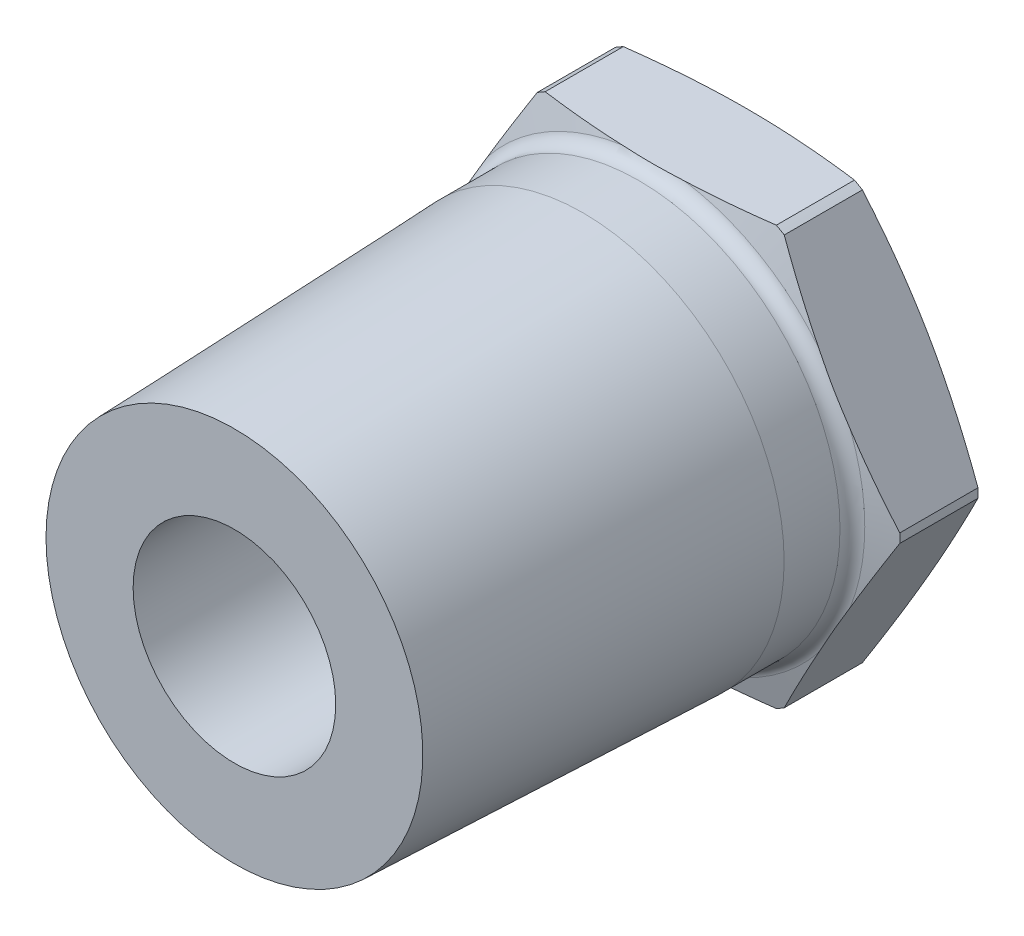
ISO-10303-21;
HEADER;
FILE_DESCRIPTION(('STEP AP214'),'2;1');
FILE_NAME('part.step','',(''),(''),'','','');
FILE_SCHEMA(('AUTOMOTIVE_DESIGN { 1 0 10303 214 1 1 1 1 }'));
ENDSEC;
DATA;
#1=APPLICATION_CONTEXT('core data for automotive mechanical design processes');
#2=APPLICATION_PROTOCOL_DEFINITION('international standard','automotive_design',2000,#1);
#3=PRODUCT_CONTEXT('',#1,'mechanical');
#4=PRODUCT('Part','Part','',(#3));
#5=PRODUCT_RELATED_PRODUCT_CATEGORY('part','',(#4));
#6=PRODUCT_DEFINITION_FORMATION('','',#4);
#7=PRODUCT_DEFINITION_CONTEXT('part definition',#1,'design');
#8=PRODUCT_DEFINITION('design','',#6,#7);
#9=PRODUCT_DEFINITION_SHAPE('','',#8);
#10=(LENGTH_UNIT() NAMED_UNIT(*) SI_UNIT(.MILLI.,.METRE.));
#11=(NAMED_UNIT(*) PLANE_ANGLE_UNIT() SI_UNIT($,.RADIAN.));
#12=(NAMED_UNIT(*) SI_UNIT($,.STERADIAN.) SOLID_ANGLE_UNIT());
#13=UNCERTAINTY_MEASURE_WITH_UNIT(LENGTH_MEASURE(1.E-05),#10,'distance_accuracy_value','');
#14=(GEOMETRIC_REPRESENTATION_CONTEXT(3) GLOBAL_UNCERTAINTY_ASSIGNED_CONTEXT((#13)) GLOBAL_UNIT_ASSIGNED_CONTEXT((#10,
#11,#12)) REPRESENTATION_CONTEXT('',''));
#15=CARTESIAN_POINT('',(0.,0.,0.));
#16=DIRECTION('',(0.,0.,1.));
#17=DIRECTION('',(1.,0.,0.));
#18=AXIS2_PLACEMENT_3D('',#15,#16,#17);
#19=CARTESIAN_POINT('',(0.,0.,4.445));
#20=DIRECTION('',(0.,0.,-1.));
#21=DIRECTION('',(-1.,0.,0.));
#22=AXIS2_PLACEMENT_3D('',#19,#20,#21);
#23=TOROIDAL_SURFACE('',#22,7.366,0.508);
#24=CARTESIAN_POINT('',(0.,0.,4.445));
#25=DIRECTION('',(0.,0.,-1.));
#26=DIRECTION('',(-1.,0.,0.));
#27=AXIS2_PLACEMENT_3D('',#24,#25,#26);
#28=CIRCLE('',#27,6.858);
#29=CARTESIAN_POINT('',(-6.858,0.,4.445));
#30=VERTEX_POINT('',#29);
#31=EDGE_CURVE('E413',#30,#30,#28,.T.);
#32=ORIENTED_EDGE('',*,*,#31,.T.);
#33=EDGE_LOOP('',(#32));
#34=FACE_BOUND('',#33,.T.);
#35=CARTESIAN_POINT('',(0.,0.,3.95929303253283));
#36=DIRECTION('',(0.,0.,1.));
#37=DIRECTION('',(1.,0.,0.));
#38=AXIS2_PLACEMENT_3D('',#35,#36,#37);
#39=CIRCLE('',#38,7.2171620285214);
#40=CARTESIAN_POINT('',(5.64615827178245,4.49536700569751,3.95929303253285));
#41=VERTEX_POINT('',#40);
#42=CARTESIAN_POINT('',(1.07002289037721,7.1374,3.95929303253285));
#43=VERTEX_POINT('',#42);
#44=EDGE_CURVE('E235',#41,#43,#39,.T.);
#45=ORIENTED_EDGE('',*,*,#44,.T.);
#46=CARTESIAN_POINT('',(0.,7.1374,3.99134149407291));
#47=CARTESIAN_POINT('',(-0.0846860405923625,7.1374,3.99134193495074));
#48=CARTESIAN_POINT('',(-0.169372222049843,7.1374,3.99057230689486));
#49=CARTESIAN_POINT('',(-0.338733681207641,7.1374,3.98761155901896));
#50=CARTESIAN_POINT('',(-0.423408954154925,7.1374,3.98542018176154));
#51=CARTESIAN_POINT('',(-0.592755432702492,7.1374,3.97994485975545));
#52=CARTESIAN_POINT('',(-0.677426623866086,7.1374,3.97666048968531));
#53=CARTESIAN_POINT('',(-0.846731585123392,7.1374,3.96949957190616));
#54=CARTESIAN_POINT('',(-0.931365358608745,7.1374,3.96562309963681));
#55=CARTESIAN_POINT('',(-1.13087838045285,7.1374,3.9565065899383));
#56=CARTESIAN_POINT('',(-1.24575835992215,7.1374,3.95127429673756));
#57=CARTESIAN_POINT('',(-1.4756478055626,7.1374,3.94262635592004));
#58=CARTESIAN_POINT('',(-1.59065730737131,7.1374,3.93921157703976));
#59=CARTESIAN_POINT('',(-1.82140683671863,7.1374,3.93628228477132));
#60=CARTESIAN_POINT('',(-1.9371473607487,7.1374,3.93678963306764));
#61=CARTESIAN_POINT('',(-2.11054041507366,7.1374,3.94256879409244));
#62=CARTESIAN_POINT('',(-2.16827196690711,7.1374,3.94532881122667));
#63=CARTESIAN_POINT('',(-2.28358934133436,7.1374,3.95297433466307));
#64=CARTESIAN_POINT('',(-2.34117518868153,7.1374,3.9578594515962));
#65=CARTESIAN_POINT('',(-2.45708717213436,7.1374,3.97042450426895));
#66=CARTESIAN_POINT('',(-2.5154083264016,7.1374,3.97815246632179));
#67=CARTESIAN_POINT('',(-2.63157717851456,7.1374,3.99720630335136));
#68=CARTESIAN_POINT('',(-2.68942388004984,7.1374,4.00853839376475));
#69=CARTESIAN_POINT('',(-2.80332593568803,7.1374,4.03578463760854));
#70=CARTESIAN_POINT('',(-2.8593946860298,7.1374,4.05163912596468));
#71=CARTESIAN_POINT('',(-2.94175083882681,7.1374,4.08021891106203));
#72=CARTESIAN_POINT('',(-2.96887468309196,7.1374,4.09052727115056));
#73=CARTESIAN_POINT('',(-3.02229419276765,7.1374,4.11308627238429));
#74=CARTESIAN_POINT('',(-3.04859050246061,7.1374,4.12533535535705));
#75=CARTESIAN_POINT('',(-3.09551282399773,7.1374,4.14990608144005));
#76=CARTESIAN_POINT('',(-3.1163344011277,7.1374,4.16185061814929));
#77=CARTESIAN_POINT('',(-3.15678842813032,7.1374,4.18776025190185));
#78=CARTESIAN_POINT('',(-3.17641741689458,7.1374,4.20173086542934));
#79=CARTESIAN_POINT('',(-3.21399784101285,7.1374,4.23228194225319));
#80=CARTESIAN_POINT('',(-3.23192397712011,7.1374,4.24889415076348));
#81=CARTESIAN_POINT('',(-3.26455040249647,7.1374,4.28503399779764));
#82=CARTESIAN_POINT('',(-3.27926590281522,7.1374,4.30454711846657));
#83=CARTESIAN_POINT('',(-3.29807195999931,7.1374,4.33710542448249));
#84=CARTESIAN_POINT('',(-3.30396291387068,7.1374,4.34910580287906));
#85=CARTESIAN_POINT('',(-3.31377974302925,7.1374,4.37388987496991));
#86=CARTESIAN_POINT('',(-3.31770769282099,7.1374,4.38667272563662));
#87=CARTESIAN_POINT('',(-3.32325994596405,7.1374,4.41284415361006));
#88=CARTESIAN_POINT('',(-3.32486634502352,7.1374,4.42623662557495));
#89=CARTESIAN_POINT('',(-3.32553377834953,7.1374,4.45308590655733));
#90=CARTESIAN_POINT('',(-3.32459515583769,7.1374,4.46654270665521));
#91=CARTESIAN_POINT('',(-3.32048320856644,7.1374,4.49183339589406));
#92=CARTESIAN_POINT('',(-3.31752223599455,7.1374,4.50370311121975));
#93=CARTESIAN_POINT('',(-3.30984396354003,7.1374,4.52685391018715));
#94=CARTESIAN_POINT('',(-3.30512580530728,7.1374,4.53813470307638));
#95=CARTESIAN_POINT('',(-3.29152265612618,7.1374,4.56541381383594));
#96=CARTESIAN_POINT('',(-3.28173307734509,7.1374,4.58095923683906));
#97=CARTESIAN_POINT('',(-3.25984811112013,7.1374,4.61033050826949));
#98=CARTESIAN_POINT('',(-3.24774639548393,7.1374,4.62415146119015));
#99=CARTESIAN_POINT('',(-3.21282691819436,7.1374,4.6594332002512));
#100=CARTESIAN_POINT('',(-3.18848894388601,7.1374,4.67937393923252));
#101=CARTESIAN_POINT('',(-3.13726688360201,7.1374,4.71560500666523));
#102=CARTESIAN_POINT('',(-3.11037616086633,7.1374,4.73188542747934));
#103=CARTESIAN_POINT('',(-3.05339063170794,7.1374,4.76248657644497));
#104=CARTESIAN_POINT('',(-3.02320044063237,7.1374,4.77662697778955));
#105=CARTESIAN_POINT('',(-2.96174484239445,7.1374,4.80237763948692));
#106=CARTESIAN_POINT('',(-2.93047824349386,7.1374,4.81398498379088));
#107=CARTESIAN_POINT('',(-2.86721654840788,7.1374,4.83515993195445));
#108=CARTESIAN_POINT('',(-2.83522038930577,7.1374,4.84472431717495));
#109=CARTESIAN_POINT('',(-2.77079591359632,7.1374,4.86213870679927));
#110=CARTESIAN_POINT('',(-2.73836790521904,7.1374,4.86998987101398));
#111=CARTESIAN_POINT('',(-2.62949100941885,7.1374,4.89385466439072));
#112=CARTESIAN_POINT('',(-2.55234551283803,7.1374,4.90668934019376));
#113=CARTESIAN_POINT('',(-2.39732648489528,7.1374,4.9269440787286));
#114=CARTESIAN_POINT('',(-2.31945220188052,7.1374,4.93435773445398));
#115=CARTESIAN_POINT('',(-2.16317018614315,7.1374,4.94524799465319));
#116=CARTESIAN_POINT('',(-2.08476154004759,7.1374,4.94871083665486));
#117=CARTESIAN_POINT('',(-1.92786315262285,7.1374,4.95273879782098));
#118=CARTESIAN_POINT('',(-1.84937339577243,7.1374,4.95330318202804));
#119=CARTESIAN_POINT('',(-1.61268228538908,7.1374,4.95194774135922));
#120=CARTESIAN_POINT('',(-1.45451242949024,7.1374,4.94692150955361));
#121=CARTESIAN_POINT('',(-1.13866475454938,7.1374,4.93417464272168));
#122=CARTESIAN_POINT('',(-0.980986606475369,7.1374,4.9264597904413));
#123=CARTESIAN_POINT('',(-0.702891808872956,7.1374,4.91428560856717));
#124=CARTESIAN_POINT('',(-0.582493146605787,7.1374,4.90948797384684));
#125=CARTESIAN_POINT('',(-0.34162655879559,7.1374,4.90227928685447));
#126=CARTESIAN_POINT('',(-0.221158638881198,7.1374,4.89986806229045));
#127=CARTESIAN_POINT('',(0.019912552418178,7.1374,4.8981623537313));
#128=CARTESIAN_POINT('',(0.140515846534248,7.1374,4.89887073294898));
#129=CARTESIAN_POINT('',(0.381667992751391,7.1374,4.90319476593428));
#130=CARTESIAN_POINT('',(0.502216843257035,7.1374,4.90681049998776));
#131=CARTESIAN_POINT('',(0.742847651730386,7.1374,4.91584327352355));
#132=CARTESIAN_POINT('',(0.862929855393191,7.1374,4.92125442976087));
#133=CARTESIAN_POINT('',(1.10308794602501,7.1374,4.93221960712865));
#134=CARTESIAN_POINT('',(1.22316383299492,7.1374,4.93777362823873));
#135=CARTESIAN_POINT('',(1.46324396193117,7.1374,4.94699504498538));
#136=CARTESIAN_POINT('',(1.58324810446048,7.1374,4.95066480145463));
#137=CARTESIAN_POINT('',(1.82330087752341,7.1374,4.95377093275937));
#138=CARTESIAN_POINT('',(1.94334946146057,7.1374,4.95320927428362));
#139=CARTESIAN_POINT('',(2.12365826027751,7.1374,4.94687713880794));
#140=CARTESIAN_POINT('',(2.1840081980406,7.1374,4.94383146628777));
#141=CARTESIAN_POINT('',(2.30458370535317,7.1374,4.93535649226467));
#142=CARTESIAN_POINT('',(2.36480917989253,7.1374,4.92992577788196));
#143=CARTESIAN_POINT('',(2.4848669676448,7.1374,4.91602410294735));
#144=CARTESIAN_POINT('',(2.54469959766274,7.1374,4.90755600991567));
#145=CARTESIAN_POINT('',(2.66363099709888,7.1374,4.8866701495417));
#146=CARTESIAN_POINT('',(2.72273037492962,7.1374,4.87425592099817));
#147=CARTESIAN_POINT('',(2.84001794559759,7.1374,4.84403360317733));
#148=CARTESIAN_POINT('',(2.89819834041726,7.1374,4.82619294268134));
#149=CARTESIAN_POINT('',(2.98328492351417,7.1374,4.79368705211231));
#150=CARTESIAN_POINT('',(3.01128207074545,7.1374,4.78189484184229));
#151=CARTESIAN_POINT('',(3.06613974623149,7.1374,4.75593568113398));
#152=CARTESIAN_POINT('',(3.09300159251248,7.1374,4.74177158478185));
#153=CARTESIAN_POINT('',(3.14516020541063,7.1374,4.710340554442));
#154=CARTESIAN_POINT('',(3.17044319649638,7.1374,4.69305037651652));
#155=CARTESIAN_POINT('',(3.217874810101,7.1374,4.65463878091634));
#156=CARTESIAN_POINT('',(3.24004079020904,7.1374,4.6335402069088));
#157=CARTESIAN_POINT('',(3.26872567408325,7.1374,4.59885855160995));
#158=CARTESIAN_POINT('',(3.2773923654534,7.1374,4.58706273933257));
#159=CARTESIAN_POINT('',(3.29299762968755,7.1374,4.56235584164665));
#160=CARTESIAN_POINT('',(3.29993628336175,7.1374,4.5494448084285));
#161=CARTESIAN_POINT('',(3.31162834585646,7.1374,4.52246163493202));
#162=CARTESIAN_POINT('',(3.31635484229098,7.1374,4.5083775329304));
#163=CARTESIAN_POINT('',(3.32296669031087,7.1374,4.47956057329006));
#164=CARTESIAN_POINT('',(3.32485695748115,7.1374,4.464828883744));
#165=CARTESIAN_POINT('',(3.3255141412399,7.1374,4.43708671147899));
#166=CARTESIAN_POINT('',(3.32463138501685,7.1374,4.42408370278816));
#167=CARTESIAN_POINT('',(3.32058771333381,7.1374,4.39843672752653));
#168=CARTESIAN_POINT('',(3.3174252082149,7.1374,4.38579301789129));
#169=CARTESIAN_POINT('',(3.30827903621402,7.1374,4.35870642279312));
#170=CARTESIAN_POINT('',(3.30185551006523,7.1374,4.34441394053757));
#171=CARTESIAN_POINT('',(3.28679092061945,7.1374,4.31705658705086));
#172=CARTESIAN_POINT('',(3.27814585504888,7.1374,4.30399399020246));
#173=CARTESIAN_POINT('',(3.25393955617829,7.1374,4.27217916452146));
#174=CARTESIAN_POINT('',(3.23721206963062,7.1374,4.25432326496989));
#175=CARTESIAN_POINT('',(3.20131968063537,7.1374,4.22128154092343));
#176=CARTESIAN_POINT('',(3.18214856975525,7.1374,4.20610276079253));
#177=CARTESIAN_POINT('',(3.1428340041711,7.1374,4.17837150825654));
#178=CARTESIAN_POINT('',(3.1227340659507,7.1374,4.16575631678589));
#179=CARTESIAN_POINT('',(3.0815368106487,7.1374,4.14225925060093));
#180=CARTESIAN_POINT('',(3.06043853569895,7.1374,4.13137908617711));
#181=CARTESIAN_POINT('',(2.99605905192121,7.1374,4.10087638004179));
#182=CARTESIAN_POINT('',(2.95174949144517,7.1374,4.08342822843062));
#183=CARTESIAN_POINT('',(2.8723676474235,7.1374,4.05638259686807));
#184=CARTESIAN_POINT('',(2.83757702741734,7.1374,4.0459039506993));
#185=CARTESIAN_POINT('',(2.76744501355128,7.1374,4.02696437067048));
#186=CARTESIAN_POINT('',(2.73210353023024,7.1374,4.01850376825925));
#187=CARTESIAN_POINT('',(2.6254181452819,7.1374,3.99558238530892));
#188=CARTESIAN_POINT('',(2.55354137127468,7.1374,3.98362232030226));
#189=CARTESIAN_POINT('',(2.40884073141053,7.1374,3.9644185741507));
#190=CARTESIAN_POINT('',(2.33601390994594,7.1374,3.95719914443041));
#191=CARTESIAN_POINT('',(2.19019101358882,7.1374,3.94633620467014));
#192=CARTESIAN_POINT('',(2.11719523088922,7.1374,3.9426885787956));
#193=CARTESIAN_POINT('',(1.95890053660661,7.1374,3.93764813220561));
#194=CARTESIAN_POINT('',(1.87358819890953,7.1374,3.93673514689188));
#195=CARTESIAN_POINT('',(1.70296714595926,7.1374,3.93739030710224));
#196=CARTESIAN_POINT('',(1.61765843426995,7.1374,3.93895890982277));
#197=CARTESIAN_POINT('',(1.36163600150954,7.1374,3.94598630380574));
#198=CARTESIAN_POINT('',(1.1909990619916,7.1374,3.95376820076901));
#199=CARTESIAN_POINT('',(0.850335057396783,7.1374,3.96931707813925));
#200=CARTESIAN_POINT('',(0.680307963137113,7.1374,3.9770840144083));
#201=CARTESIAN_POINT('',(0.425193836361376,7.1374,3.98537732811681));
#202=CARTESIAN_POINT('',(0.340169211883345,7.1374,3.98758209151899));
#203=CARTESIAN_POINT('',(0.17009643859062,7.1374,3.9905639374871));
#204=CARTESIAN_POINT('',(0.0850482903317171,7.1374,3.9913410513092));
#205=CARTESIAN_POINT('',(0.,7.1374,3.99134149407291));
#206=B_SPLINE_CURVE_WITH_KNOTS('',3,(#46,#47,#48,#49,#50,#51,#52,#53,#54,#55,#56,#57,#58,#59,
#60,#61,#62,#63,#64,#65,#66,#67,#68,#69,#70,#71,#72,#73,#74,#75,#76,#77,#78,#79,#80,#81,#82,#83,
#84,#85,#86,#87,#88,#89,#90,#91,#92,#93,#94,#95,#96,#97,#98,#99,#100,#101,#102,#103,#104,#105,
#106,#107,#108,#109,#110,#111,#112,#113,#114,#115,#116,#117,#118,#119,#120,#121,#122,#123,#124,
#125,#126,#127,#128,#129,#130,#131,#132,#133,#134,#135,#136,#137,#138,#139,#140,#141,#142,#143,
#144,#145,#146,#147,#148,#149,#150,#151,#152,#153,#154,#155,#156,#157,#158,#159,#160,#161,#162,
#163,#164,#165,#166,#167,#168,#169,#170,#171,#172,#173,#174,#175,#176,#177,#178,#179,#180,#181,
#182,#183,#184,#185,#186,#187,#188,#189,#190,#191,#192,#193,#194,#195,#196,#197,#198,#199,#200,
#201,#202,#203,#204,#205),.UNSPECIFIED.,.T.,.F.,(4,2,2,2,2,2,2,2,2,2,2,2,2,2,2,2,2,2,2,2,2,2,2,
2,2,2,2,2,2,2,2,2,2,2,2,2,2,2,2,2,2,2,2,2,2,2,2,2,2,2,2,2,2,2,2,2,2,2,2,2,2,2,2,2,2,2,2,2,2,2,2,
2,2,2,2,2,2,2,2,4),(0.,0.254055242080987,0.508156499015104,0.762356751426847,1.01652464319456,
1.36151807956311,1.70667626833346,2.05375972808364,2.22712197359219,2.4004524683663,
2.57685676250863,2.75356693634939,2.92804577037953,3.01504004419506,3.10196482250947,
3.17389299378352,3.24602081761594,3.31909202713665,3.3918091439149,3.43177754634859,
3.47170362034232,3.51193599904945,3.55216295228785,3.5887088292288,3.62527258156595,
3.68007052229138,3.73502064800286,3.82888054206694,3.92299151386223,4.02284816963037,
4.12281918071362,4.22294655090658,4.32300592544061,4.55729316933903,4.79185686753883,
5.02723518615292,5.26267318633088,5.73730721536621,6.21092662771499,6.5723951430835,
6.93383755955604,7.29561178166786,7.65739599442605,8.01800623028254,8.37861641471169,
8.73877367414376,9.0987635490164,9.28000781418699,9.4613595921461,9.64254060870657,
9.82355960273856,10.0056873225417,10.096744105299,10.1876920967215,10.2793464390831,
10.3704682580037,10.414268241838,10.4580661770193,10.5023839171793,10.54662475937,
10.5855111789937,10.6244247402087,10.6711743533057,10.718008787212,10.7909974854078,
10.8641754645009,10.935259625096,11.0064134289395,11.1489206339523,11.2578720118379,
11.3668412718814,11.5851806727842,11.8046284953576,12.0238231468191,12.2797213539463,
12.53566671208,13.0480762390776,13.5586792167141,13.8138267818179,14.0689687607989),.UNSPECIFIED.);
#207=CARTESIAN_POINT('',(-1.07002289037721,7.1374,3.95929303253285));
#208=VERTEX_POINT('',#207);
#209=EDGE_CURVE('E376',#43,#208,#206,.T.);
#210=ORIENTED_EDGE('',*,*,#209,.T.);
#211=CARTESIAN_POINT('',(-5.64615827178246,4.4953670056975,3.95929303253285));
#212=VERTEX_POINT('',#211);
#213=EDGE_CURVE('E368',#208,#212,#39,.T.);
#214=ORIENTED_EDGE('',*,*,#213,.T.);
#215=CARTESIAN_POINT('',(-5.64395633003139,4.49918088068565,3.95909303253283));
#216=CARTESIAN_POINT('',(-5.68626581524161,4.42589870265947,3.96295370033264));
#217=CARTESIAN_POINT('',(-5.72857540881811,4.35261633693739,3.9668690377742));
#218=CARTESIAN_POINT('',(-5.8132123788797,4.20602080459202,3.97425794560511));
#219=CARTESIAN_POINT('',(-5.85553975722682,4.13270763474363,3.97773142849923));
#220=CARTESIAN_POINT('',(-5.94017537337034,3.98611444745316,3.98368090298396));
#221=CARTESIAN_POINT('',(-5.98248359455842,3.91283445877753,3.98615778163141));
#222=CARTESIAN_POINT('',(-6.06711072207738,3.76625597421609,3.98975179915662));
#223=CARTESIAN_POINT('',(-6.1094296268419,3.69295748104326,3.99086907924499));
#224=CARTESIAN_POINT('',(-6.1989693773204,3.53787008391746,3.99161020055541));
#225=CARTESIAN_POINT('',(-6.24619065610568,3.45608042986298,3.99104621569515));
#226=CARTESIAN_POINT('',(-6.34062404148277,3.29251700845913,3.9881144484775));
#227=CARTESIAN_POINT('',(-6.38783614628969,3.21074324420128,3.98574644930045));
#228=CARTESIAN_POINT('',(-6.48228298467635,3.04715652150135,3.97963814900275));
#229=CARTESIAN_POINT('',(-6.52951769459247,2.96534360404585,3.97589649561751));
#230=CARTESIAN_POINT('',(-6.62396301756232,2.80175950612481,3.96778266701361));
#231=CARTESIAN_POINT('',(-6.67117363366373,2.71998832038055,3.96341063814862));
#232=CARTESIAN_POINT('',(-6.71838310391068,2.63821911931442,3.95909303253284));
#233=B_SPLINE_CURVE_WITH_KNOTS('',3,(#215,#216,#217,#218,#219,#220,#221,#222,#223,#224,#225,
#226,#227,#228,#229,#230,#231,#232),.UNSPECIFIED.,.F.,.F.,(4,2,2,2,2,2,2,2,4),(0.,
0.25412574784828,0.508301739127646,0.762250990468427,1.01617386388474,1.29948702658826,
1.58283424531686,1.86646115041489,2.15002231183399),.UNSPECIFIED.);
#234=CARTESIAN_POINT('',(-6.71618116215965,2.6420329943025,3.95929303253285));
#235=VERTEX_POINT('',#234);
#236=EDGE_CURVE('E314',#212,#235,#233,.T.);
#237=ORIENTED_EDGE('',*,*,#236,.T.);
#238=CARTESIAN_POINT('',(-6.71618116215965,-2.64203299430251,3.95929303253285));
#239=VERTEX_POINT('',#238);
#240=EDGE_CURVE('E377',#235,#239,#39,.T.);
#241=ORIENTED_EDGE('',*,*,#240,.T.);
#242=CARTESIAN_POINT('',(-6.71838310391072,-2.63821911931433,3.95909303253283));
#243=CARTESIAN_POINT('',(-6.67607361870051,-2.71150129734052,3.96295370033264));
#244=CARTESIAN_POINT('',(-6.63376402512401,-2.78478366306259,3.9668690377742));
#245=CARTESIAN_POINT('',(-6.54912705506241,-2.93137919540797,3.9742579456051));
#246=CARTESIAN_POINT('',(-6.5067996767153,-3.00469236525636,3.97773142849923));
#247=CARTESIAN_POINT('',(-6.42216406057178,-3.15128555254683,3.98368090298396));
#248=CARTESIAN_POINT('',(-6.3798558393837,-3.22456554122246,3.98615778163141));
#249=CARTESIAN_POINT('',(-6.29522871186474,-3.3711440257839,3.98975179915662));
#250=CARTESIAN_POINT('',(-6.25290980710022,-3.44444251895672,3.99086907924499));
#251=CARTESIAN_POINT('',(-6.16337005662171,-3.59952991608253,3.99161020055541));
#252=CARTESIAN_POINT('',(-6.11614877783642,-3.68131957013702,3.99104621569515));
#253=CARTESIAN_POINT('',(-6.02171539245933,-3.84488299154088,3.9881144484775));
#254=CARTESIAN_POINT('',(-5.9745032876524,-3.92665675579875,3.98574644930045));
#255=CARTESIAN_POINT('',(-5.88005644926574,-4.09024347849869,3.97963814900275));
#256=CARTESIAN_POINT('',(-5.83282173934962,-4.17205639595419,3.97589649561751));
#257=CARTESIAN_POINT('',(-5.73837641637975,-4.33564049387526,3.9677826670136));
#258=CARTESIAN_POINT('',(-5.69116580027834,-4.41741167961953,3.96341063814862));
#259=CARTESIAN_POINT('',(-5.64395633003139,-4.49918088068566,3.95909303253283));
#260=B_SPLINE_CURVE_WITH_KNOTS('',3,(#242,#243,#244,#245,#246,#247,#248,#249,#250,#251,#252,
#253,#254,#255,#256,#257,#258,#259),.UNSPECIFIED.,.F.,.F.,(4,2,2,2,2,2,2,2,4),(0.,
0.25412574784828,0.508301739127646,0.762250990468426,1.01617386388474,1.29948702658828,
1.58283424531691,1.86646115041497,2.1500223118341),.UNSPECIFIED.);
#261=CARTESIAN_POINT('',(-5.64615827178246,-4.49536700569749,3.95929303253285));
#262=VERTEX_POINT('',#261);
#263=EDGE_CURVE('E305',#239,#262,#260,.T.);
#264=ORIENTED_EDGE('',*,*,#263,.T.);
#265=CARTESIAN_POINT('',(-1.07002289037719,-7.1374,3.95929303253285));
#266=VERTEX_POINT('',#265);
#267=EDGE_CURVE('E378',#262,#266,#39,.T.);
#268=ORIENTED_EDGE('',*,*,#267,.T.);
#269=CARTESIAN_POINT('',(0.,-7.1374,3.99134149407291));
#270=CARTESIAN_POINT('',(0.084686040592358,-7.1374,3.99134193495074));
#271=CARTESIAN_POINT('',(0.169372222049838,-7.1374,3.99057230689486));
#272=CARTESIAN_POINT('',(0.338733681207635,-7.1374,3.98761155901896));
#273=CARTESIAN_POINT('',(0.423408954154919,-7.1374,3.98542018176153));
#274=CARTESIAN_POINT('',(0.592755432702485,-7.1374,3.97994485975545));
#275=CARTESIAN_POINT('',(0.677426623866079,-7.1374,3.97666048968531));
#276=CARTESIAN_POINT('',(0.846731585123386,-7.1374,3.96949957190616));
#277=CARTESIAN_POINT('',(0.93136535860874,-7.1374,3.96562309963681));
#278=CARTESIAN_POINT('',(1.13087838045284,-7.1374,3.9565065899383));
#279=CARTESIAN_POINT('',(1.24575835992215,-7.1374,3.95127429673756));
#280=CARTESIAN_POINT('',(1.47564780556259,-7.1374,3.94262635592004));
#281=CARTESIAN_POINT('',(1.59065730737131,-7.1374,3.93921157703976));
#282=CARTESIAN_POINT('',(1.82140683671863,-7.1374,3.93628228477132));
#283=CARTESIAN_POINT('',(1.9371473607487,-7.1374,3.93678963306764));
#284=CARTESIAN_POINT('',(2.11054041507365,-7.1374,3.94256879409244));
#285=CARTESIAN_POINT('',(2.1682719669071,-7.1374,3.94532881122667));
#286=CARTESIAN_POINT('',(2.28358934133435,-7.1374,3.95297433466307));
#287=CARTESIAN_POINT('',(2.34117518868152,-7.1374,3.9578594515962));
#288=CARTESIAN_POINT('',(2.45708717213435,-7.1374,3.97042450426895));
#289=CARTESIAN_POINT('',(2.51540832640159,-7.1374,3.97815246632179));
#290=CARTESIAN_POINT('',(2.63157717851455,-7.1374,3.99720630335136));
#291=CARTESIAN_POINT('',(2.68942388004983,-7.1374,4.00853839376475));
#292=CARTESIAN_POINT('',(2.80332593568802,-7.1374,4.03578463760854));
#293=CARTESIAN_POINT('',(2.85939468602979,-7.1374,4.05163912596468));
#294=CARTESIAN_POINT('',(2.9417508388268,-7.1374,4.08021891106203));
#295=CARTESIAN_POINT('',(2.96887468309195,-7.1374,4.09052727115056));
#296=CARTESIAN_POINT('',(3.02229419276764,-7.1374,4.11308627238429));
#297=CARTESIAN_POINT('',(3.0485905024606,-7.1374,4.12533535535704));
#298=CARTESIAN_POINT('',(3.09551282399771,-7.1374,4.14990608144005));
#299=CARTESIAN_POINT('',(3.11633440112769,-7.1374,4.16185061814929));
#300=CARTESIAN_POINT('',(3.15678842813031,-7.1374,4.18776025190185));
#301=CARTESIAN_POINT('',(3.17641741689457,-7.1374,4.20173086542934));
#302=CARTESIAN_POINT('',(3.21399784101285,-7.1374,4.23228194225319));
#303=CARTESIAN_POINT('',(3.23192397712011,-7.1374,4.24889415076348));
#304=CARTESIAN_POINT('',(3.26455040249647,-7.1374,4.28503399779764));
#305=CARTESIAN_POINT('',(3.27926590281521,-7.1374,4.30454711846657));
#306=CARTESIAN_POINT('',(3.29807195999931,-7.1374,4.33710542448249));
#307=CARTESIAN_POINT('',(3.30396291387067,-7.1374,4.34910580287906));
#308=CARTESIAN_POINT('',(3.31377974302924,-7.1374,4.37388987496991));
#309=CARTESIAN_POINT('',(3.31770769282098,-7.1374,4.38667272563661));
#310=CARTESIAN_POINT('',(3.32325994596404,-7.1374,4.41284415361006));
#311=CARTESIAN_POINT('',(3.32486634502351,-7.1374,4.42623662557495));
#312=CARTESIAN_POINT('',(3.32553377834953,-7.1374,4.45308590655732));
#313=CARTESIAN_POINT('',(3.32459515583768,-7.1374,4.46654270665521));
#314=CARTESIAN_POINT('',(3.32048320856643,-7.1374,4.49183339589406));
#315=CARTESIAN_POINT('',(3.31752223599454,-7.1374,4.50370311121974));
#316=CARTESIAN_POINT('',(3.30984396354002,-7.1374,4.52685391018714));
#317=CARTESIAN_POINT('',(3.30512580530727,-7.1374,4.53813470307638));
#318=CARTESIAN_POINT('',(3.29152265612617,-7.1374,4.56541381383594));
#319=CARTESIAN_POINT('',(3.28173307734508,-7.1374,4.58095923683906));
#320=CARTESIAN_POINT('',(3.25984811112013,-7.1374,4.61033050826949));
#321=CARTESIAN_POINT('',(3.24774639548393,-7.1374,4.62415146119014));
#322=CARTESIAN_POINT('',(3.21282691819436,-7.1374,4.6594332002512));
#323=CARTESIAN_POINT('',(3.18848894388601,-7.1374,4.67937393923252));
#324=CARTESIAN_POINT('',(3.13726688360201,-7.1374,4.71560500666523));
#325=CARTESIAN_POINT('',(3.11037616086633,-7.1374,4.73188542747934));
#326=CARTESIAN_POINT('',(3.05339063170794,-7.1374,4.76248657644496));
#327=CARTESIAN_POINT('',(3.02320044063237,-7.1374,4.77662697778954));
#328=CARTESIAN_POINT('',(2.96174484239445,-7.1374,4.80237763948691));
#329=CARTESIAN_POINT('',(2.93047824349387,-7.1374,4.81398498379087));
#330=CARTESIAN_POINT('',(2.86721654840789,-7.1374,4.83515993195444));
#331=CARTESIAN_POINT('',(2.83522038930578,-7.1374,4.84472431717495));
#332=CARTESIAN_POINT('',(2.77079591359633,-7.1374,4.86213870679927));
#333=CARTESIAN_POINT('',(2.73836790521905,-7.1374,4.86998987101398));
#334=CARTESIAN_POINT('',(2.62949100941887,-7.1374,4.89385466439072));
#335=CARTESIAN_POINT('',(2.55234551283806,-7.1374,4.90668934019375));
#336=CARTESIAN_POINT('',(2.39732648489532,-7.1374,4.9269440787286));
#337=CARTESIAN_POINT('',(2.31945220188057,-7.1374,4.93435773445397));
#338=CARTESIAN_POINT('',(2.16317018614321,-7.1374,4.94524799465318));
#339=CARTESIAN_POINT('',(2.08476154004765,-7.1374,4.94871083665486));
#340=CARTESIAN_POINT('',(1.92786315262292,-7.1374,4.95273879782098));
#341=CARTESIAN_POINT('',(1.84937339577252,-7.1374,4.95330318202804));
#342=CARTESIAN_POINT('',(1.61268228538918,-7.1374,4.95194774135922));
#343=CARTESIAN_POINT('',(1.45451242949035,-7.1374,4.94692150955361));
#344=CARTESIAN_POINT('',(1.13866475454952,-7.1374,4.93417464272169));
#345=CARTESIAN_POINT('',(0.980986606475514,-7.1374,4.92645979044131));
#346=CARTESIAN_POINT('',(0.70289180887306,-7.1374,4.91428560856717));
#347=CARTESIAN_POINT('',(0.582493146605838,-7.1374,4.90948797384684));
#348=CARTESIAN_POINT('',(0.341626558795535,-7.1374,4.90227928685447));
#349=CARTESIAN_POINT('',(0.221158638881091,-7.1374,4.89986806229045));
#350=CARTESIAN_POINT('',(-0.0199125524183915,-7.1374,4.89816235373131));
#351=CARTESIAN_POINT('',(-0.140515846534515,-7.1374,4.89887073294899));
#352=CARTESIAN_POINT('',(-0.381667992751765,-7.1374,4.90319476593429));
#353=CARTESIAN_POINT('',(-0.502216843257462,-7.1374,4.90681049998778));
#354=CARTESIAN_POINT('',(-0.74284765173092,-7.1374,4.91584327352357));
#355=CARTESIAN_POINT('',(-0.862929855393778,-7.1374,4.9212544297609));
#356=CARTESIAN_POINT('',(-1.1030879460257,-7.1374,4.93221960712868));
#357=CARTESIAN_POINT('',(-1.22316383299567,-7.1374,4.93777362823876));
#358=CARTESIAN_POINT('',(-1.46324396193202,-7.1374,4.94699504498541));
#359=CARTESIAN_POINT('',(-1.58324810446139,-7.1374,4.95066480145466));
#360=CARTESIAN_POINT('',(-1.82330087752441,-7.1374,4.95377093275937));
#361=CARTESIAN_POINT('',(-1.94334946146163,-7.1374,4.95320927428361));
#362=CARTESIAN_POINT('',(-2.12365826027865,-7.1374,4.94687713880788));
#363=CARTESIAN_POINT('',(-2.18400819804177,-7.1374,4.9438314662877));
#364=CARTESIAN_POINT('',(-2.30458370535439,-7.1374,4.93535649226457));
#365=CARTESIAN_POINT('',(-2.36480917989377,-7.1374,4.92992577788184));
#366=CARTESIAN_POINT('',(-2.48486696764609,-7.1374,4.91602410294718));
#367=CARTESIAN_POINT('',(-2.54469959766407,-7.1374,4.90755600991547));
#368=CARTESIAN_POINT('',(-2.66363099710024,-7.1374,4.88667014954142));
#369=CARTESIAN_POINT('',(-2.72273037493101,-7.1374,4.87425592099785));
#370=CARTESIAN_POINT('',(-2.84001794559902,-7.1374,4.84403360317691));
#371=CARTESIAN_POINT('',(-2.8981983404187,-7.1374,4.82619294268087));
#372=CARTESIAN_POINT('',(-2.98328492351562,-7.1374,4.79368705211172));
#373=CARTESIAN_POINT('',(-3.0112820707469,-7.1374,4.78189484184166));
#374=CARTESIAN_POINT('',(-3.06613974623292,-7.1374,4.75593568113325));
#375=CARTESIAN_POINT('',(-3.09300159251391,-7.1374,4.74177158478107));
#376=CARTESIAN_POINT('',(-3.14516020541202,-7.1374,4.71034055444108));
#377=CARTESIAN_POINT('',(-3.17044319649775,-7.1374,4.69305037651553));
#378=CARTESIAN_POINT('',(-3.21787481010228,-7.1374,4.65463878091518));
#379=CARTESIAN_POINT('',(-3.24004079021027,-7.1374,4.63354020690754));
#380=CARTESIAN_POINT('',(-3.26872567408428,-7.1374,4.5988585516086));
#381=CARTESIAN_POINT('',(-3.27739236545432,-7.1374,4.58706273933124));
#382=CARTESIAN_POINT('',(-3.29299762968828,-7.1374,4.56235584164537));
#383=CARTESIAN_POINT('',(-3.29993628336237,-7.1374,4.54944480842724));
#384=CARTESIAN_POINT('',(-3.31162834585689,-7.1374,4.52246163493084));
#385=CARTESIAN_POINT('',(-3.31635484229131,-7.1374,4.50837753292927));
#386=CARTESIAN_POINT('',(-3.32296669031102,-7.1374,4.47956057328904));
#387=CARTESIAN_POINT('',(-3.32485695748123,-7.1374,4.46482888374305));
#388=CARTESIAN_POINT('',(-3.32551414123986,-7.1374,4.43708671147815));
#389=CARTESIAN_POINT('',(-3.32463138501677,-7.1374,4.42408370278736));
#390=CARTESIAN_POINT('',(-3.32058771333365,-7.1374,4.3984367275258));
#391=CARTESIAN_POINT('',(-3.3174252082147,-7.1374,4.38579301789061));
#392=CARTESIAN_POINT('',(-3.30827903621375,-7.1374,4.35870642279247));
#393=CARTESIAN_POINT('',(-3.3018555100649,-7.1374,4.34441394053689));
#394=CARTESIAN_POINT('',(-3.286790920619,-7.1374,4.31705658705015));
#395=CARTESIAN_POINT('',(-3.27814585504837,-7.1374,4.30399399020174));
#396=CARTESIAN_POINT('',(-3.25393955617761,-7.1374,4.27217916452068));
#397=CARTESIAN_POINT('',(-3.23721206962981,-7.1374,4.25432326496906));
#398=CARTESIAN_POINT('',(-3.20131968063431,-7.1374,4.22128154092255));
#399=CARTESIAN_POINT('',(-3.18214856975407,-7.1374,4.20610276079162));
#400=CARTESIAN_POINT('',(-3.14283400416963,-7.1374,4.17837150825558));
#401=CARTESIAN_POINT('',(-3.12273406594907,-7.1374,4.1657563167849));
#402=CARTESIAN_POINT('',(-3.08153681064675,-7.1374,4.14225925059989));
#403=CARTESIAN_POINT('',(-3.06043853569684,-7.1374,4.13137908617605));
#404=CARTESIAN_POINT('',(-2.99605905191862,-7.1374,4.10087638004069));
#405=CARTESIAN_POINT('',(-2.95174949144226,-7.1374,4.08342822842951));
#406=CARTESIAN_POINT('',(-2.87236764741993,-7.1374,4.05638259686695));
#407=CARTESIAN_POINT('',(-2.83757702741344,-7.1374,4.04590395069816));
#408=CARTESIAN_POINT('',(-2.76744501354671,-7.1374,4.02696437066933));
#409=CARTESIAN_POINT('',(-2.73210353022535,-7.1374,4.01850376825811));
#410=CARTESIAN_POINT('',(-2.62541814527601,-7.1374,3.99558238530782));
#411=CARTESIAN_POINT('',(-2.55354137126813,-7.1374,3.98362232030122));
#412=CARTESIAN_POINT('',(-2.40884073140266,-7.1374,3.96441857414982));
#413=CARTESIAN_POINT('',(-2.3360139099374,-7.1374,3.95719914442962));
#414=CARTESIAN_POINT('',(-2.19019101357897,-7.1374,3.94633620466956));
#415=CARTESIAN_POINT('',(-2.11719523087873,-7.1374,3.94268857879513));
#416=CARTESIAN_POINT('',(-1.95890053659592,-7.1374,3.93764813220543));
#417=CARTESIAN_POINT('',(-1.8735881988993,-7.1374,3.93673514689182));
#418=CARTESIAN_POINT('',(-1.70296714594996,-7.1374,3.93739030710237));
#419=CARTESIAN_POINT('',(-1.6176584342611,-7.1374,3.93895890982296));
#420=CARTESIAN_POINT('',(-1.36163600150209,-7.1374,3.94598630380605));
#421=CARTESIAN_POINT('',(-1.19099906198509,-7.1374,3.95376820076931));
#422=CARTESIAN_POINT('',(-0.850335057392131,-7.1374,3.96931707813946));
#423=CARTESIAN_POINT('',(-0.680307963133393,-7.1374,3.97708401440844));
#424=CARTESIAN_POINT('',(-0.425193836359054,-7.1374,3.98537732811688));
#425=CARTESIAN_POINT('',(-0.340169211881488,-7.1374,3.98758209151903));
#426=CARTESIAN_POINT('',(-0.170096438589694,-7.1374,3.99056393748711));
#427=CARTESIAN_POINT('',(-0.0850482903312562,-7.1374,3.99134105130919));
#428=CARTESIAN_POINT('',(0.,-7.1374,3.99134149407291));
#429=B_SPLINE_CURVE_WITH_KNOTS('',3,(#269,#270,#271,#272,#273,#274,#275,#276,#277,#278,#279,
#280,#281,#282,#283,#284,#285,#286,#287,#288,#289,#290,#291,#292,#293,#294,#295,#296,#297,#298,
#299,#300,#301,#302,#303,#304,#305,#306,#307,#308,#309,#310,#311,#312,#313,#314,#315,#316,#317,
#318,#319,#320,#321,#322,#323,#324,#325,#326,#327,#328,#329,#330,#331,#332,#333,#334,#335,#336,
#337,#338,#339,#340,#341,#342,#343,#344,#345,#346,#347,#348,#349,#350,#351,#352,#353,#354,#355,
#356,#357,#358,#359,#360,#361,#362,#363,#364,#365,#366,#367,#368,#369,#370,#371,#372,#373,#374,
#375,#376,#377,#378,#379,#380,#381,#382,#383,#384,#385,#386,#387,#388,#389,#390,#391,#392,#393,
#394,#395,#396,#397,#398,#399,#400,#401,#402,#403,#404,#405,#406,#407,#408,#409,#410,#411,#412,
#413,#414,#415,#416,#417,#418,#419,#420,#421,#422,#423,#424,#425,#426,#427,#428),.UNSPECIFIED.,
.T.,.F.,(4,2,2,2,2,2,2,2,2,2,2,2,2,2,2,2,2,2,2,2,2,2,2,2,2,2,2,2,2,2,2,2,2,2,2,2,2,2,2,2,2,2,2,
2,2,2,2,2,2,2,2,2,2,2,2,2,2,2,2,2,2,2,2,2,2,2,2,2,2,2,2,2,2,2,2,2,2,2,2,4),(0.,
0.254055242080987,0.508156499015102,0.762356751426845,1.01652464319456,1.36151807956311,
1.70667626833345,2.05375972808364,2.22712197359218,2.4004524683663,2.57685676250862,
2.75356693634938,2.92804577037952,3.01504004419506,3.10196482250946,3.17389299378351,
3.24602081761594,3.31909202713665,3.3918091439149,3.43177754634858,3.47170362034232,
3.51193599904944,3.55216295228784,3.58870882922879,3.62527258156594,3.68007052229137,
3.73502064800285,3.82888054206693,3.92299151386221,4.02284816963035,4.1228191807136,
4.22294655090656,4.32300592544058,4.55729316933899,4.79185686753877,5.02723518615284,
5.26267318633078,5.73730721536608,6.21092662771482,6.57239514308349,6.93383755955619,
7.29561178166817,7.65739599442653,8.01800623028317,8.37861641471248,8.7387736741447,
9.0987635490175,9.28000781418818,9.46135959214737,9.64254060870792,9.82355960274,
10.0056873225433,10.0967441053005,10.1876920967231,10.2793464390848,10.3704682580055,
10.4142682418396,10.4580661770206,10.5023839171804,10.5466247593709,10.5855111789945,
10.6244247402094,10.6711743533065,10.7180087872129,10.790997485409,10.8641754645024,
10.9352596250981,11.006413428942,11.1489206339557,11.2578720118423,11.3668412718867,
11.5851806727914,11.8046284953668,12.0238231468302,12.279721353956,12.5356667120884,
13.0480762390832,13.5586792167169,13.8138267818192,14.0689687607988),.UNSPECIFIED.);
#430=CARTESIAN_POINT('',(1.07002289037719,-7.1374,3.95929303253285));
#431=VERTEX_POINT('',#430);
#432=EDGE_CURVE('E298',#266,#431,#429,.T.);
#433=ORIENTED_EDGE('',*,*,#432,.T.);
#434=CARTESIAN_POINT('',(5.64615827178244,-4.49536700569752,3.95929303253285));
#435=VERTEX_POINT('',#434);
#436=EDGE_CURVE('E234',#431,#435,#39,.T.);
#437=ORIENTED_EDGE('',*,*,#436,.T.);
#438=CARTESIAN_POINT('',(5.64395633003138,-4.49918088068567,3.95909303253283));
#439=CARTESIAN_POINT('',(5.6862658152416,-4.42589870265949,3.96295370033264));
#440=CARTESIAN_POINT('',(5.72857540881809,-4.35261633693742,3.9668690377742));
#441=CARTESIAN_POINT('',(5.81321237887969,-4.20602080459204,3.97425794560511));
#442=CARTESIAN_POINT('',(5.8555397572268,-4.13270763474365,3.97773142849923));
#443=CARTESIAN_POINT('',(5.94017537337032,-3.98611444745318,3.98368090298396));
#444=CARTESIAN_POINT('',(5.98248359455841,-3.91283445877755,3.98615778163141));
#445=CARTESIAN_POINT('',(6.06711072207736,-3.76625597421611,3.98975179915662));
#446=CARTESIAN_POINT('',(6.10942962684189,-3.69295748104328,3.990869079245));
#447=CARTESIAN_POINT('',(6.19896937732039,-3.53787008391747,3.99161020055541));
#448=CARTESIAN_POINT('',(6.24619065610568,-3.45608042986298,3.99104621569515));
#449=CARTESIAN_POINT('',(6.34062404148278,-3.29251700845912,3.98811444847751));
#450=CARTESIAN_POINT('',(6.3878361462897,-3.21074324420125,3.98574644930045));
#451=CARTESIAN_POINT('',(6.48228298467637,-3.0471565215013,3.97963814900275));
#452=CARTESIAN_POINT('',(6.52951769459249,-2.9653436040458,3.97589649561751));
#453=CARTESIAN_POINT('',(6.62396301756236,-2.80175950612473,3.9677826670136));
#454=CARTESIAN_POINT('',(6.67117363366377,-2.71998832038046,3.96341063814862));
#455=CARTESIAN_POINT('',(6.71838310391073,-2.63821911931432,3.95909303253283));
#456=B_SPLINE_CURVE_WITH_KNOTS('',3,(#438,#439,#440,#441,#442,#443,#444,#445,#446,#447,#448,
#449,#450,#451,#452,#453,#454,#455),.UNSPECIFIED.,.F.,.F.,(4,2,2,2,2,2,2,2,4),(0.,
0.25412574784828,0.508301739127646,0.762250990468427,1.01617386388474,1.29948702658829,
1.58283424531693,1.866461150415,2.15002231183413),.UNSPECIFIED.);
#457=CARTESIAN_POINT('',(6.71618116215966,-2.64203299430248,3.95929303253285));
#458=VERTEX_POINT('',#457);
#459=EDGE_CURVE('E289',#435,#458,#456,.T.);
#460=ORIENTED_EDGE('',*,*,#459,.T.);
#461=CARTESIAN_POINT('',(6.71618116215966,2.64203299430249,3.95929303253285));
#462=VERTEX_POINT('',#461);
#463=EDGE_CURVE('E231',#458,#462,#39,.T.);
#464=ORIENTED_EDGE('',*,*,#463,.T.);
#465=CARTESIAN_POINT('',(6.71838310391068,2.63821911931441,3.95909303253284));
#466=CARTESIAN_POINT('',(6.67607361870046,2.71150129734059,3.96295370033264));
#467=CARTESIAN_POINT('',(6.63376402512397,2.78478366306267,3.96686903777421));
#468=CARTESIAN_POINT('',(6.54912705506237,2.93137919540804,3.97425794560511));
#469=CARTESIAN_POINT('',(6.50679967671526,3.00469236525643,3.97773142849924));
#470=CARTESIAN_POINT('',(6.42216406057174,3.1512855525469,3.98368090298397));
#471=CARTESIAN_POINT('',(6.37985583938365,3.22456554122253,3.98615778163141));
#472=CARTESIAN_POINT('',(6.2952287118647,3.37114402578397,3.98975179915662));
#473=CARTESIAN_POINT('',(6.25290980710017,3.4444425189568,3.990869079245));
#474=CARTESIAN_POINT('',(6.16337005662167,3.5995299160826,3.99161020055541));
#475=CARTESIAN_POINT('',(6.11614877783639,3.68131957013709,3.99104621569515));
#476=CARTESIAN_POINT('',(6.0217153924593,3.84488299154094,3.9881144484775));
#477=CARTESIAN_POINT('',(5.97450328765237,3.92665675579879,3.98574644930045));
#478=CARTESIAN_POINT('',(5.88005644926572,4.09024347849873,3.97963814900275));
#479=CARTESIAN_POINT('',(5.8328217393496,4.17205639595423,3.97589649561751));
#480=CARTESIAN_POINT('',(5.73837641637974,4.33564049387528,3.9677826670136));
#481=CARTESIAN_POINT('',(5.69116580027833,4.41741167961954,3.96341063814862));
#482=CARTESIAN_POINT('',(5.64395633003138,4.49918088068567,3.95909303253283));
#483=B_SPLINE_CURVE_WITH_KNOTS('',3,(#465,#466,#467,#468,#469,#470,#471,#472,#473,#474,#475,
#476,#477,#478,#479,#480,#481,#482),.UNSPECIFIED.,.F.,.F.,(4,2,2,2,2,2,2,2,4),(0.,
0.254125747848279,0.508301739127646,0.762250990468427,1.01617386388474,1.29948702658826,
1.58283424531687,1.86646115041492,2.15002231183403),.UNSPECIFIED.);
#484=EDGE_CURVE('E201',#462,#41,#483,.T.);
#485=ORIENTED_EDGE('',*,*,#484,.T.);
#486=EDGE_LOOP('',(#45,#210,#214,#237,#241,#264,#268,#433,#437,#460,#464,#485));
#487=FACE_BOUND('',#486,.T.);
#488=ADVANCED_FACE('F36',(#34,#487),#23,.F.);
#489=CARTESIAN_POINT('',(0.,0.,-1.69911153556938));
#490=DIRECTION('',(0.,0.,-1.));
#491=DIRECTION('',(-1.,0.,0.));
#492=AXIS2_PLACEMENT_3D('',#489,#490,#491);
#493=CYLINDRICAL_SURFACE('',#492,8.1534);
#494=CARTESIAN_POINT('',(0.,0.,1.03423637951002));
#495=DIRECTION('',(0.,0.,-1.));
#496=DIRECTION('',(-1.,0.,0.));
#497=AXIS2_PLACEMENT_3D('',#494,#495,#496);
#498=CIRCLE('',#497,8.1534);
#499=CARTESIAN_POINT('',(4.21041777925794,6.98214248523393,1.03423637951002));
#500=VERTEX_POINT('',#499);
#501=CARTESIAN_POINT('',(3.94150387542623,7.1374,1.03423637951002));
#502=VERTEX_POINT('',#501);
#503=EDGE_CURVE('E200',#500,#502,#498,.F.);
#504=ORIENTED_EDGE('',*,*,#503,.T.);
#505=DIRECTION('',(0.,0.,-1.));
#506=VECTOR('',#505,1.);
#507=CARTESIAN_POINT('',(3.94150387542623,7.1374,-1.69911153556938));
#508=LINE('',#507,#506);
#509=CARTESIAN_POINT('',(3.94150387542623,7.1374,3.69900345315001));
#510=VERTEX_POINT('',#509);
#511=EDGE_CURVE('E408',#502,#510,#508,.F.);
#512=ORIENTED_EDGE('',*,*,#511,.T.);
#513=CARTESIAN_POINT('',(0.,0.,3.69900345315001));
#514=DIRECTION('',(0.,0.,1.));
#515=DIRECTION('',(1.,0.,0.));
#516=AXIS2_PLACEMENT_3D('',#513,#514,#515);
#517=CIRCLE('',#516,8.1534);
#518=CARTESIAN_POINT('',(4.21041777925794,6.98214248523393,3.69900345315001));
#519=VERTEX_POINT('',#518);
#520=EDGE_CURVE('E224',#510,#519,#517,.F.);
#521=ORIENTED_EDGE('',*,*,#520,.T.);
#522=DIRECTION('',(0.,0.,-1.));
#523=VECTOR('',#522,1.);
#524=CARTESIAN_POINT('',(4.21041777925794,6.98214248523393,-1.69911153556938));
#525=LINE('',#524,#523);
#526=EDGE_CURVE('E53',#519,#500,#525,.T.);
#527=ORIENTED_EDGE('',*,*,#526,.T.);
#528=EDGE_LOOP('',(#504,#512,#521,#527));
#529=FACE_BOUND('',#528,.T.);
#530=ADVANCED_FACE('F280',(#529),#493,.T.);
#531=CARTESIAN_POINT('',(-4.21041777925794,6.98214248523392,3.69900345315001));
#532=VERTEX_POINT('',#531);
#533=CARTESIAN_POINT('',(-3.94150387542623,7.1374,3.69900345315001));
#534=VERTEX_POINT('',#533);
#535=EDGE_CURVE('E369',#532,#534,#517,.F.);
#536=ORIENTED_EDGE('',*,*,#535,.T.);
#537=DIRECTION('',(0.,0.,-1.));
#538=VECTOR('',#537,1.);
#539=CARTESIAN_POINT('',(-3.94150387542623,7.1374,-1.69911153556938));
#540=LINE('',#539,#538);
#541=CARTESIAN_POINT('',(-3.94150387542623,7.1374,1.03423637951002));
#542=VERTEX_POINT('',#541);
#543=EDGE_CURVE('E61',#534,#542,#540,.T.);
#544=ORIENTED_EDGE('',*,*,#543,.T.);
#545=CARTESIAN_POINT('',(-4.21041777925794,6.98214248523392,1.03423637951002));
#546=VERTEX_POINT('',#545);
#547=EDGE_CURVE('E229',#542,#546,#498,.F.);
#548=ORIENTED_EDGE('',*,*,#547,.T.);
#549=DIRECTION('',(0.,0.,-1.));
#550=VECTOR('',#549,1.);
#551=CARTESIAN_POINT('',(-4.21041777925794,6.98214248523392,-1.69911153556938));
#552=LINE('',#551,#550);
#553=EDGE_CURVE('E463',#546,#532,#552,.F.);
#554=ORIENTED_EDGE('',*,*,#553,.T.);
#555=EDGE_LOOP('',(#536,#544,#548,#554));
#556=FACE_BOUND('',#555,.T.);
#557=ADVANCED_FACE('F474',(#556),#493,.T.);
#558=CARTESIAN_POINT('',(-8.15192165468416,-0.155257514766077,3.69900345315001));
#559=VERTEX_POINT('',#558);
#560=CARTESIAN_POINT('',(-8.15192165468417,0.15525751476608,3.69900345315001));
#561=VERTEX_POINT('',#560);
#562=EDGE_CURVE('E519',#559,#561,#517,.F.);
#563=ORIENTED_EDGE('',*,*,#562,.T.);
#564=DIRECTION('',(0.,0.,-1.));
#565=VECTOR('',#564,1.);
#566=CARTESIAN_POINT('',(-8.15192165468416,0.155257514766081,-1.69911153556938));
#567=LINE('',#566,#565);
#568=CARTESIAN_POINT('',(-8.15192165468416,0.155257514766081,1.03423637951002));
#569=VERTEX_POINT('',#568);
#570=EDGE_CURVE('E324',#561,#569,#567,.T.);
#571=ORIENTED_EDGE('',*,*,#570,.T.);
#572=CARTESIAN_POINT('',(-8.15192165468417,-0.15525751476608,1.03423637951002));
#573=VERTEX_POINT('',#572);
#574=EDGE_CURVE('E226',#569,#573,#498,.F.);
#575=ORIENTED_EDGE('',*,*,#574,.T.);
#576=DIRECTION('',(0.,0.,-1.));
#577=VECTOR('',#576,1.);
#578=CARTESIAN_POINT('',(-8.15192165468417,-0.15525751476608,-1.69911153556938));
#579=LINE('',#578,#577);
#580=EDGE_CURVE('E455',#573,#559,#579,.F.);
#581=ORIENTED_EDGE('',*,*,#580,.T.);
#582=EDGE_LOOP('',(#563,#571,#575,#581));
#583=FACE_BOUND('',#582,.T.);
#584=ADVANCED_FACE('F518',(#583),#493,.T.);
#585=CARTESIAN_POINT('',(-3.94150387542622,-7.1374,3.69900345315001));
#586=VERTEX_POINT('',#585);
#587=CARTESIAN_POINT('',(-4.21041777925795,-6.98214248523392,3.69900345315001));
#588=VERTEX_POINT('',#587);
#589=EDGE_CURVE('E486',#586,#588,#517,.F.);
#590=ORIENTED_EDGE('',*,*,#589,.T.);
#591=DIRECTION('',(0.,0.,-1.));
#592=VECTOR('',#591,1.);
#593=CARTESIAN_POINT('',(-4.21041777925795,-6.98214248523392,-1.69911153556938));
#594=LINE('',#593,#592);
#595=CARTESIAN_POINT('',(-4.21041777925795,-6.98214248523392,1.03423637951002));
#596=VERTEX_POINT('',#595);
#597=EDGE_CURVE('E485',#588,#596,#594,.T.);
#598=ORIENTED_EDGE('',*,*,#597,.T.);
#599=CARTESIAN_POINT('',(-3.94150387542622,-7.1374,1.03423637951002));
#600=VERTEX_POINT('',#599);
#601=EDGE_CURVE('E230',#596,#600,#498,.F.);
#602=ORIENTED_EDGE('',*,*,#601,.T.);
#603=DIRECTION('',(0.,0.,-1.));
#604=VECTOR('',#603,1.);
#605=CARTESIAN_POINT('',(-3.94150387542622,-7.1374,-1.69911153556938));
#606=LINE('',#605,#604);
#607=EDGE_CURVE('E444',#600,#586,#606,.F.);
#608=ORIENTED_EDGE('',*,*,#607,.T.);
#609=EDGE_LOOP('',(#590,#598,#602,#608));
#610=FACE_BOUND('',#609,.T.);
#611=ADVANCED_FACE('F483',(#610),#493,.T.);
#612=CARTESIAN_POINT('',(4.21041777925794,-6.98214248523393,3.69900345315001));
#613=VERTEX_POINT('',#612);
#614=CARTESIAN_POINT('',(3.94150387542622,-7.1374,3.69900345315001));
#615=VERTEX_POINT('',#614);
#616=EDGE_CURVE('E225',#613,#615,#517,.F.);
#617=ORIENTED_EDGE('',*,*,#616,.T.);
#618=DIRECTION('',(0.,0.,-1.));
#619=VECTOR('',#618,1.);
#620=CARTESIAN_POINT('',(3.94150387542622,-7.1374,-1.69911153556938));
#621=LINE('',#620,#619);
#622=CARTESIAN_POINT('',(3.94150387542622,-7.1374,1.03423637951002));
#623=VERTEX_POINT('',#622);
#624=EDGE_CURVE('E530',#615,#623,#621,.T.);
#625=ORIENTED_EDGE('',*,*,#624,.T.);
#626=CARTESIAN_POINT('',(4.21041777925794,-6.98214248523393,1.03423637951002));
#627=VERTEX_POINT('',#626);
#628=EDGE_CURVE('E441',#623,#627,#498,.F.);
#629=ORIENTED_EDGE('',*,*,#628,.T.);
#630=DIRECTION('',(0.,0.,-1.));
#631=VECTOR('',#630,1.);
#632=CARTESIAN_POINT('',(4.21041777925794,-6.98214248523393,-1.69911153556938));
#633=LINE('',#632,#631);
#634=EDGE_CURVE('E531',#627,#613,#633,.F.);
#635=ORIENTED_EDGE('',*,*,#634,.T.);
#636=EDGE_LOOP('',(#617,#625,#629,#635));
#637=FACE_BOUND('',#636,.T.);
#638=ADVANCED_FACE('F533',(#637),#493,.T.);
#639=CARTESIAN_POINT('',(8.15192165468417,0.155257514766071,3.69900345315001));
#640=VERTEX_POINT('',#639);
#641=CARTESIAN_POINT('',(8.15192165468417,-0.155257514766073,3.69900345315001));
#642=VERTEX_POINT('',#641);
#643=EDGE_CURVE('E216',#640,#642,#517,.F.);
#644=ORIENTED_EDGE('',*,*,#643,.T.);
#645=DIRECTION('',(0.,0.,-1.));
#646=VECTOR('',#645,1.);
#647=CARTESIAN_POINT('',(8.15192165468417,-0.155257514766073,-1.69911153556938));
#648=LINE('',#647,#646);
#649=CARTESIAN_POINT('',(8.15192165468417,-0.155257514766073,1.03423637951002));
#650=VERTEX_POINT('',#649);
#651=EDGE_CURVE('E189',#642,#650,#648,.T.);
#652=ORIENTED_EDGE('',*,*,#651,.T.);
#653=CARTESIAN_POINT('',(8.15192165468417,0.155257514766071,1.03423637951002));
#654=VERTEX_POINT('',#653);
#655=EDGE_CURVE('E476',#650,#654,#498,.F.);
#656=ORIENTED_EDGE('',*,*,#655,.T.);
#657=DIRECTION('',(0.,0.,-1.));
#658=VECTOR('',#657,1.);
#659=CARTESIAN_POINT('',(8.15192165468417,0.155257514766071,-1.69911153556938));
#660=LINE('',#659,#658);
#661=EDGE_CURVE('E184',#654,#640,#660,.F.);
#662=ORIENTED_EDGE('',*,*,#661,.T.);
#663=EDGE_LOOP('',(#644,#652,#656,#662));
#664=FACE_BOUND('',#663,.T.);
#665=ADVANCED_FACE('F498',(#664),#493,.T.);
#666=CARTESIAN_POINT('',(0.,0.,0.762));
#667=DIRECTION('',(0.,0.,1.));
#668=DIRECTION('',(1.,0.,0.));
#669=AXIS2_PLACEMENT_3D('',#666,#667,#668);
#670=CONICAL_SURFACE('',#669,7.13739999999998,1.30899693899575);
#671=ORIENTED_EDGE('',*,*,#547,.F.);
#672=CARTESIAN_POINT('',(-10.8930407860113,7.1374,2.33906529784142));
#673=CARTESIAN_POINT('',(-10.5693274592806,7.1374,2.2665330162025));
#674=CARTESIAN_POINT('',(-10.2454114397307,7.1374,2.19488913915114));
#675=CARTESIAN_POINT('',(-9.59707448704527,7.1374,2.05385772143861));
#676=CARTESIAN_POINT('',(-9.27265353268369,7.1374,1.98447027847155));
#677=CARTESIAN_POINT('',(-8.62291547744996,7.1374,1.84837064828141));
#678=CARTESIAN_POINT('',(-8.29759780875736,7.1374,1.78166116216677));
#679=CARTESIAN_POINT('',(-7.64628477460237,7.1374,1.65163877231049));
#680=CARTESIAN_POINT('',(-7.32028941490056,7.1374,1.58832583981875));
#681=CARTESIAN_POINT('',(-6.67010572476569,7.1374,1.46639362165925));
#682=CARTESIAN_POINT('',(-6.3459236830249,7.1374,1.40774096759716));
#683=CARTESIAN_POINT('',(-5.69667489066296,7.1374,1.29556504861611));
#684=CARTESIAN_POINT('',(-5.37160815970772,7.1374,1.24204167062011));
#685=CARTESIAN_POINT('',(-4.72052781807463,7.1374,1.14133110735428));
#686=CARTESIAN_POINT('',(-4.39451433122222,7.1374,1.09414312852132));
#687=CARTESIAN_POINT('',(-3.74145018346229,7.1374,1.0074953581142));
#688=CARTESIAN_POINT('',(-3.41439952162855,7.1374,0.968035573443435));
#689=CARTESIAN_POINT('',(-2.75557447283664,7.1374,0.897963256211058));
#690=CARTESIAN_POINT('',(-2.4237886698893,7.1374,0.867456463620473));
#691=CARTESIAN_POINT('',(-1.75938467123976,7.1374,0.817395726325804));
#692=CARTESIAN_POINT('',(-1.42676649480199,7.1374,0.797841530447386));
#693=CARTESIAN_POINT('',(-0.761180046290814,7.1374,0.77082655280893));
#694=CARTESIAN_POINT('',(-0.428212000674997,7.1374,0.763360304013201));
#695=CARTESIAN_POINT('',(0.237769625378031,7.1374,0.760980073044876));
#696=CARTESIAN_POINT('',(0.570783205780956,7.1374,0.766066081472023));
#697=CARTESIAN_POINT('',(1.23760030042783,7.1374,0.788504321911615));
#698=CARTESIAN_POINT('',(1.57140228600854,7.1374,0.805901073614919));
#699=CARTESIAN_POINT('',(2.23822018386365,7.1374,0.851968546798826));
#700=CARTESIAN_POINT('',(2.57123607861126,7.1374,0.88063951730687));
#701=CARTESIAN_POINT('',(3.23647922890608,7.1374,0.947809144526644));
#702=CARTESIAN_POINT('',(3.56870582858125,7.1374,0.986314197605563));
#703=CARTESIAN_POINT('',(4.23209014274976,7.1374,1.07155219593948));
#704=CARTESIAN_POINT('',(4.56324785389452,7.1374,1.11828516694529));
#705=CARTESIAN_POINT('',(5.20227376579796,7.1374,1.21511415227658));
#706=CARTESIAN_POINT('',(5.51020903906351,7.1374,1.26477198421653));
#707=CARTESIAN_POINT('',(6.12526931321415,7.1374,1.36889715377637));
#708=CARTESIAN_POINT('',(6.43239429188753,7.1374,1.42336462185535));
#709=CARTESIAN_POINT('',(7.0459459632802,7.1374,1.53623027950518));
#710=CARTESIAN_POINT('',(7.35237259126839,7.1374,1.59462881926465));
#711=CARTESIAN_POINT('',(7.96459734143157,7.1374,1.71463995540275));
#712=CARTESIAN_POINT('',(8.27039545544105,7.1374,1.77625259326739));
#713=CARTESIAN_POINT('',(9.18711603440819,7.1374,1.96503944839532));
#714=CARTESIAN_POINT('',(9.79722966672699,7.1374,2.0961371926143));
#715=CARTESIAN_POINT('',(11.0158356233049,7.1374,2.36542724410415));
#716=CARTESIAN_POINT('',(11.6243280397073,7.1374,2.50361913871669));
#717=CARTESIAN_POINT('',(12.8341775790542,7.1374,2.78362001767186));
#718=CARTESIAN_POINT('',(13.4355460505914,7.1374,2.92538010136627));
#719=CARTESIAN_POINT('',(14.6374438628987,7.1374,3.21245082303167));
#720=CARTESIAN_POINT('',(15.2379731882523,7.1374,3.35776152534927));
#721=CARTESIAN_POINT('',(16.4376520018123,7.1374,3.65082690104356));
#722=CARTESIAN_POINT('',(17.0368022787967,7.1374,3.79857835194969));
#723=CARTESIAN_POINT('',(18.2345806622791,7.1374,4.09610062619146));
#724=CARTESIAN_POINT('',(18.8332087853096,7.1374,4.2458713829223));
#725=CARTESIAN_POINT('',(19.4316548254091,7.1374,4.39635752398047));
#726=B_SPLINE_CURVE_WITH_KNOTS('',3,(#672,#673,#674,#675,#676,#677,#678,#679,#680,#681,#682,
#683,#684,#685,#686,#687,#688,#689,#690,#691,#692,#693,#694,#695,#696,#697,#698,#699,#700,#701,
#702,#703,#704,#705,#706,#707,#708,#709,#710,#711,#712,#713,#714,#715,#716,#717,#718,#719,#720,
#721,#722,#723,#724,#725),.UNSPECIFIED.,.F.,.F.,(4,2,2,2,2,2,2,2,2,2,2,2,2,2,2,2,2,2,2,2,2,2,2,
2,2,2,4),(0.,0.995223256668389,1.99048954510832,2.98673569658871,3.98297341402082,
4.97127605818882,5.95955690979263,6.94771385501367,7.93587168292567,8.9352694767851,
9.93464435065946,10.9335671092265,11.9324891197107,12.9350421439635,13.9376173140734,
14.9408462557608,15.9440783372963,16.8797739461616,17.8154949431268,18.7512994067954,
19.6871159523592,21.5591612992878,23.4310978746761,25.2846358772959,27.1382074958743,
28.9895015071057,30.8407346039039),.UNSPECIFIED.);
#727=CARTESIAN_POINT('',(0.,7.1374,0.762));
#728=VERTEX_POINT('',#727);
#729=EDGE_CURVE('E411',#542,#728,#726,.T.);
#730=ORIENTED_EDGE('',*,*,#729,.T.);
#731=CARTESIAN_POINT('',(0.,0.,0.762));
#732=DIRECTION('',(0.,0.,-1.));
#733=DIRECTION('',(-1.,0.,0.));
#734=AXIS2_PLACEMENT_3D('',#731,#732,#733);
#735=CIRCLE('',#734,7.13739999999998);
#736=CARTESIAN_POINT('',(-6.18116971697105,3.5687,0.762));
#737=VERTEX_POINT('',#736);
#738=EDGE_CURVE('E215',#737,#728,#735,.T.);
#739=ORIENTED_EDGE('',*,*,#738,.F.);
#740=CARTESIAN_POINT('',(-8.15269355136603,0.153920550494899,1.03443637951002));
#741=CARTESIAN_POINT('',(-7.9889181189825,0.437587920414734,0.991975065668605));
#742=CARTESIAN_POINT('',(-7.82485986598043,0.721745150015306,0.953525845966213));
#743=CARTESIAN_POINT('',(-7.49620353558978,1.29099461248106,0.886092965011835));
#744=CARTESIAN_POINT('',(-7.33160529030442,1.57608713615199,0.85711260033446));
#745=CARTESIAN_POINT('',(-7.0027961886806,2.14560120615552,0.81020268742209));
#746=CARTESIAN_POINT('',(-6.8385872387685,2.43001945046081,0.792221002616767));
#747=CARTESIAN_POINT('',(-6.50997540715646,2.99919183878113,0.768120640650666));
#748=CARTESIAN_POINT('',(-6.34557256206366,3.28394591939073,0.762000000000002));
#749=CARTESIAN_POINT('',(-6.01676687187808,3.85345408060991,0.762000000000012));
#750=CARTESIAN_POINT('',(-5.85236402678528,4.13820816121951,0.768120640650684));
#751=CARTESIAN_POINT('',(-5.52375219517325,4.70738054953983,0.792221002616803));
#752=CARTESIAN_POINT('',(-5.35954324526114,4.99179879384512,0.810202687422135));
#753=CARTESIAN_POINT('',(-5.03073414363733,5.56131286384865,0.85711260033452));
#754=CARTESIAN_POINT('',(-4.86613589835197,5.84640538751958,0.886092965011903));
#755=CARTESIAN_POINT('',(-4.53747956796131,6.41565484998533,0.953525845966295));
#756=CARTESIAN_POINT('',(-4.37342131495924,6.6998120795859,0.991975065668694));
#757=CARTESIAN_POINT('',(-4.20964588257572,6.98347944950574,1.03443637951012));
#758=B_SPLINE_CURVE_WITH_KNOTS('',3,(#740,#741,#742,#743,#744,#745,#746,#747,#748,#749,#750,
#751,#752,#753,#754,#755,#756,#757),.UNSPECIFIED.,.F.,.F.,(4,2,2,2,2,2,2,2,4),(0.,
0.990918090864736,1.98218080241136,2.96870750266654,3.95507087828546,4.94143425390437,
5.92796095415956,6.91922366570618,7.91014175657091),.UNSPECIFIED.);
#759=EDGE_CURVE('E464',#737,#546,#758,.T.);
#760=ORIENTED_EDGE('',*,*,#759,.T.);
#761=EDGE_LOOP('',(#671,#730,#739,#760));
#762=FACE_BOUND('',#761,.T.);
#763=ADVANCED_FACE('F475',(#762),#670,.T.);
#764=CARTESIAN_POINT('',(6.18116971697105,3.5687,0.762));
#765=VERTEX_POINT('',#764);
#766=EDGE_CURVE('E197',#728,#765,#735,.T.);
#767=ORIENTED_EDGE('',*,*,#766,.F.);
#768=EDGE_CURVE('E410',#728,#502,#726,.T.);
#769=ORIENTED_EDGE('',*,*,#768,.T.);
#770=ORIENTED_EDGE('',*,*,#503,.F.);
#771=CARTESIAN_POINT('',(4.20964588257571,6.98347944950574,1.03443637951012));
#772=CARTESIAN_POINT('',(4.37342131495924,6.69981207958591,0.991975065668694));
#773=CARTESIAN_POINT('',(4.53747956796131,6.41565484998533,0.953525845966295));
#774=CARTESIAN_POINT('',(4.86613589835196,5.84640538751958,0.886092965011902));
#775=CARTESIAN_POINT('',(5.03073414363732,5.56131286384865,0.85711260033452));
#776=CARTESIAN_POINT('',(5.35954324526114,4.99179879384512,0.810202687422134));
#777=CARTESIAN_POINT('',(5.52375219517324,4.70738054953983,0.792221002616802));
#778=CARTESIAN_POINT('',(5.85236402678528,4.13820816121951,0.768120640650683));
#779=CARTESIAN_POINT('',(6.01676687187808,3.85345408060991,0.762000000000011));
#780=CARTESIAN_POINT('',(6.34557256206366,3.28394591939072,0.762000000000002));
#781=CARTESIAN_POINT('',(6.50997540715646,2.99919183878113,0.768120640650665));
#782=CARTESIAN_POINT('',(6.8385872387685,2.43001945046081,0.792221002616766));
#783=CARTESIAN_POINT('',(7.0027961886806,2.14560120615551,0.810202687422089));
#784=CARTESIAN_POINT('',(7.33160529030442,1.57608713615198,0.857112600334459));
#785=CARTESIAN_POINT('',(7.49620353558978,1.29099461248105,0.886092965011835));
#786=CARTESIAN_POINT('',(7.82485986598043,0.721745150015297,0.953525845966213));
#787=CARTESIAN_POINT('',(7.9889181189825,0.437587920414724,0.991975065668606));
#788=CARTESIAN_POINT('',(8.15269355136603,0.15392055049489,1.03443637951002));
#789=B_SPLINE_CURVE_WITH_KNOTS('',3,(#771,#772,#773,#774,#775,#776,#777,#778,#779,#780,#781,
#782,#783,#784,#785,#786,#787,#788),.UNSPECIFIED.,.F.,.F.,(4,2,2,2,2,2,2,2,4),(0.,
0.990918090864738,1.98218080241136,2.96870750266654,3.95507087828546,4.94143425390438,
5.92796095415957,6.91922366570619,7.91014175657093),.UNSPECIFIED.);
#790=EDGE_CURVE('E182',#500,#765,#789,.T.);
#791=ORIENTED_EDGE('',*,*,#790,.T.);
#792=EDGE_LOOP('',(#767,#769,#770,#791));
#793=FACE_BOUND('',#792,.T.);
#794=ADVANCED_FACE('F194',(#793),#670,.T.);
#795=ORIENTED_EDGE('',*,*,#574,.F.);
#796=EDGE_CURVE('E323',#569,#737,#758,.T.);
#797=ORIENTED_EDGE('',*,*,#796,.T.);
#798=CARTESIAN_POINT('',(-6.18116971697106,-3.5687,0.762));
#799=VERTEX_POINT('',#798);
#800=EDGE_CURVE('E217',#799,#737,#735,.T.);
#801=ORIENTED_EDGE('',*,*,#800,.F.);
#802=CARTESIAN_POINT('',(-4.20964588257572,-6.98347944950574,1.03443637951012));
#803=CARTESIAN_POINT('',(-4.37342131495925,-6.6998120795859,0.991975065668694));
#804=CARTESIAN_POINT('',(-4.53747956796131,-6.41565484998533,0.953525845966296));
#805=CARTESIAN_POINT('',(-4.86613589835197,-5.84640538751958,0.886092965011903));
#806=CARTESIAN_POINT('',(-5.03073414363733,-5.56131286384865,0.85711260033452));
#807=CARTESIAN_POINT('',(-5.35954324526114,-4.99179879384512,0.810202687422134));
#808=CARTESIAN_POINT('',(-5.52375219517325,-4.70738054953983,0.792221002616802));
#809=CARTESIAN_POINT('',(-5.85236402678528,-4.13820816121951,0.768120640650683));
#810=CARTESIAN_POINT('',(-6.01676687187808,-3.85345408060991,0.762000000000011));
#811=CARTESIAN_POINT('',(-6.34557256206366,-3.28394591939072,0.762000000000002));
#812=CARTESIAN_POINT('',(-6.50997540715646,-2.99919183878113,0.768120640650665));
#813=CARTESIAN_POINT('',(-6.8385872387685,-2.43001945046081,0.792221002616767));
#814=CARTESIAN_POINT('',(-7.0027961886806,-2.14560120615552,0.81020268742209));
#815=CARTESIAN_POINT('',(-7.33160529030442,-1.57608713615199,0.857112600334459));
#816=CARTESIAN_POINT('',(-7.49620353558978,-1.29099461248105,0.886092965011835));
#817=CARTESIAN_POINT('',(-7.82485986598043,-0.721745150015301,0.953525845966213));
#818=CARTESIAN_POINT('',(-7.9889181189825,-0.437587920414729,0.991975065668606));
#819=CARTESIAN_POINT('',(-8.15269355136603,-0.153920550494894,1.03443637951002));
#820=B_SPLINE_CURVE_WITH_KNOTS('',3,(#802,#803,#804,#805,#806,#807,#808,#809,#810,#811,#812,
#813,#814,#815,#816,#817,#818,#819),.UNSPECIFIED.,.F.,.F.,(4,2,2,2,2,2,2,2,4),(0.,
0.990918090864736,1.98218080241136,2.96870750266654,3.95507087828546,4.94143425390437,
5.92796095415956,6.91922366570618,7.91014175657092),.UNSPECIFIED.);
#821=EDGE_CURVE('E456',#799,#573,#820,.T.);
#822=ORIENTED_EDGE('',*,*,#821,.T.);
#823=EDGE_LOOP('',(#795,#797,#801,#822));
#824=FACE_BOUND('',#823,.T.);
#825=ADVANCED_FACE('F461',(#824),#670,.T.);
#826=ORIENTED_EDGE('',*,*,#601,.F.);
#827=EDGE_CURVE('E452',#596,#799,#820,.T.);
#828=ORIENTED_EDGE('',*,*,#827,.T.);
#829=CARTESIAN_POINT('',(0.,-7.1374,0.762));
#830=VERTEX_POINT('',#829);
#831=EDGE_CURVE('E429',#830,#799,#735,.T.);
#832=ORIENTED_EDGE('',*,*,#831,.F.);
#833=CARTESIAN_POINT('',(-10.8930407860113,-7.1374,2.33906529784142));
#834=CARTESIAN_POINT('',(-10.5693274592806,-7.1374,2.2665330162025));
#835=CARTESIAN_POINT('',(-10.2454114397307,-7.1374,2.19488913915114));
#836=CARTESIAN_POINT('',(-9.59707448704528,-7.1374,2.05385772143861));
#837=CARTESIAN_POINT('',(-9.2726535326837,-7.1374,1.98447027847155));
#838=CARTESIAN_POINT('',(-8.62291547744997,-7.1374,1.84837064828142));
#839=CARTESIAN_POINT('',(-8.29759780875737,-7.1374,1.78166116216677));
#840=CARTESIAN_POINT('',(-7.64628477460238,-7.1374,1.65163877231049));
#841=CARTESIAN_POINT('',(-7.32028941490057,-7.1374,1.58832583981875));
#842=CARTESIAN_POINT('',(-6.6701057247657,-7.1374,1.46639362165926));
#843=CARTESIAN_POINT('',(-6.34592368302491,-7.1374,1.40774096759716));
#844=CARTESIAN_POINT('',(-5.69667489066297,-7.1374,1.29556504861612));
#845=CARTESIAN_POINT('',(-5.37160815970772,-7.1374,1.24204167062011));
#846=CARTESIAN_POINT('',(-4.72052781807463,-7.1374,1.14133110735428));
#847=CARTESIAN_POINT('',(-4.39451433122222,-7.1374,1.09414312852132));
#848=CARTESIAN_POINT('',(-3.74145018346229,-7.1374,1.0074953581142));
#849=CARTESIAN_POINT('',(-3.41439952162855,-7.1374,0.968035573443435));
#850=CARTESIAN_POINT('',(-2.75557447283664,-7.1374,0.897963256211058));
#851=CARTESIAN_POINT('',(-2.4237886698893,-7.1374,0.867456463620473));
#852=CARTESIAN_POINT('',(-1.75938467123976,-7.1374,0.817395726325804));
#853=CARTESIAN_POINT('',(-1.42676649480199,-7.1374,0.797841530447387));
#854=CARTESIAN_POINT('',(-0.761180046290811,-7.1374,0.77082655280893));
#855=CARTESIAN_POINT('',(-0.428212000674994,-7.1374,0.763360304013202));
#856=CARTESIAN_POINT('',(0.237769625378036,-7.1374,0.760980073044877));
#857=CARTESIAN_POINT('',(0.570783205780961,-7.1374,0.766066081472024));
#858=CARTESIAN_POINT('',(1.23760030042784,-7.1374,0.788504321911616));
#859=CARTESIAN_POINT('',(1.57140228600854,-7.1374,0.80590107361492));
#860=CARTESIAN_POINT('',(2.23822018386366,-7.1374,0.851968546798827));
#861=CARTESIAN_POINT('',(2.57123607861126,-7.1374,0.880639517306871));
#862=CARTESIAN_POINT('',(3.23647922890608,-7.1374,0.947809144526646));
#863=CARTESIAN_POINT('',(3.56870582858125,-7.1374,0.986314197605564));
#864=CARTESIAN_POINT('',(4.23209014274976,-7.1374,1.07155219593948));
#865=CARTESIAN_POINT('',(4.56324785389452,-7.1374,1.11828516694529));
#866=CARTESIAN_POINT('',(5.20227376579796,-7.1374,1.21511415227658));
#867=CARTESIAN_POINT('',(5.51020903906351,-7.1374,1.26477198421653));
#868=CARTESIAN_POINT('',(6.12526931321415,-7.1374,1.36889715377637));
#869=CARTESIAN_POINT('',(6.43239429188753,-7.1374,1.42336462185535));
#870=CARTESIAN_POINT('',(7.0459459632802,-7.1374,1.53623027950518));
#871=CARTESIAN_POINT('',(7.35237259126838,-7.1374,1.59462881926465));
#872=CARTESIAN_POINT('',(7.96459734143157,-7.1374,1.71463995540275));
#873=CARTESIAN_POINT('',(8.27039545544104,-7.1374,1.77625259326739));
#874=CARTESIAN_POINT('',(9.18711603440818,-7.1374,1.96503944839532));
#875=CARTESIAN_POINT('',(9.79722966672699,-7.13740000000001,2.0961371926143));
#876=CARTESIAN_POINT('',(11.0158356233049,-7.13740000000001,2.36542724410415));
#877=CARTESIAN_POINT('',(11.6243280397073,-7.13740000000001,2.50361913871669));
#878=CARTESIAN_POINT('',(12.8341775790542,-7.13740000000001,2.78362001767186));
#879=CARTESIAN_POINT('',(13.4355460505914,-7.13740000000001,2.92538010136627));
#880=CARTESIAN_POINT('',(14.6374438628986,-7.13740000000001,3.21245082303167));
#881=CARTESIAN_POINT('',(15.2379731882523,-7.13740000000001,3.35776152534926));
#882=CARTESIAN_POINT('',(16.4376520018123,-7.13740000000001,3.65082690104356));
#883=CARTESIAN_POINT('',(17.0368022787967,-7.13740000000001,3.79857835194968));
#884=CARTESIAN_POINT('',(18.2345806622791,-7.13740000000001,4.09610062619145));
#885=CARTESIAN_POINT('',(18.8332087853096,-7.13740000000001,4.2458713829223));
#886=CARTESIAN_POINT('',(19.4316548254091,-7.13740000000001,4.39635752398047));
#887=B_SPLINE_CURVE_WITH_KNOTS('',3,(#833,#834,#835,#836,#837,#838,#839,#840,#841,#842,#843,
#844,#845,#846,#847,#848,#849,#850,#851,#852,#853,#854,#855,#856,#857,#858,#859,#860,#861,#862,
#863,#864,#865,#866,#867,#868,#869,#870,#871,#872,#873,#874,#875,#876,#877,#878,#879,#880,#881,
#882,#883,#884,#885,#886),.UNSPECIFIED.,.F.,.F.,(4,2,2,2,2,2,2,2,2,2,2,2,2,2,2,2,2,2,2,2,2,2,2,
2,2,2,4),(0.,0.995223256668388,1.99048954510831,2.9867356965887,3.98297341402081,
4.97127605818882,5.95955690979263,6.94771385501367,7.93587168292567,8.93526947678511,
9.93464435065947,10.9335671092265,11.9324891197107,12.9350421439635,13.9376173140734,
14.9408462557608,15.9440783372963,16.8797739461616,17.8154949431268,18.7512994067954,
19.6871159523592,21.5591612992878,23.431097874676,25.2846358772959,27.1382074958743,
28.9895015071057,30.8407346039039),.UNSPECIFIED.);
#888=EDGE_CURVE('E445',#830,#600,#887,.F.);
#889=ORIENTED_EDGE('',*,*,#888,.T.);
#890=EDGE_LOOP('',(#826,#828,#832,#889));
#891=FACE_BOUND('',#890,.T.);
#892=ADVANCED_FACE('F450',(#891),#670,.T.);
#893=ORIENTED_EDGE('',*,*,#628,.F.);
#894=EDGE_CURVE('E440',#623,#830,#887,.F.);
#895=ORIENTED_EDGE('',*,*,#894,.T.);
#896=CARTESIAN_POINT('',(6.18116971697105,-3.5687,0.762));
#897=VERTEX_POINT('',#896);
#898=EDGE_CURVE('E210',#897,#830,#735,.T.);
#899=ORIENTED_EDGE('',*,*,#898,.F.);
#900=CARTESIAN_POINT('',(8.15269355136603,-0.153920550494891,1.03443637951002));
#901=CARTESIAN_POINT('',(7.9889181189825,-0.437587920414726,0.991975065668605));
#902=CARTESIAN_POINT('',(7.82485986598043,-0.721745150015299,0.953525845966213));
#903=CARTESIAN_POINT('',(7.49620353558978,-1.29099461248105,0.886092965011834));
#904=CARTESIAN_POINT('',(7.33160529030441,-1.57608713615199,0.857112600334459));
#905=CARTESIAN_POINT('',(7.0027961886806,-2.14560120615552,0.810202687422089));
#906=CARTESIAN_POINT('',(6.83858723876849,-2.43001945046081,0.792221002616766));
#907=CARTESIAN_POINT('',(6.50997540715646,-2.99919183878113,0.768120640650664));
#908=CARTESIAN_POINT('',(6.34557256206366,-3.28394591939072,0.762000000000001));
#909=CARTESIAN_POINT('',(6.01676687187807,-3.85345408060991,0.76200000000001));
#910=CARTESIAN_POINT('',(5.85236402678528,-4.13820816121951,0.768120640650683));
#911=CARTESIAN_POINT('',(5.52375219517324,-4.70738054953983,0.792221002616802));
#912=CARTESIAN_POINT('',(5.35954324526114,-4.99179879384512,0.810202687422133));
#913=CARTESIAN_POINT('',(5.03073414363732,-5.56131286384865,0.857112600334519));
#914=CARTESIAN_POINT('',(4.86613589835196,-5.84640538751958,0.886092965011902));
#915=CARTESIAN_POINT('',(4.53747956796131,-6.41565484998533,0.953525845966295));
#916=CARTESIAN_POINT('',(4.37342131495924,-6.69981207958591,0.991975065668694));
#917=CARTESIAN_POINT('',(4.20964588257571,-6.98347944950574,1.03443637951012));
#918=B_SPLINE_CURVE_WITH_KNOTS('',3,(#900,#901,#902,#903,#904,#905,#906,#907,#908,#909,#910,
#911,#912,#913,#914,#915,#916,#917),.UNSPECIFIED.,.F.,.F.,(4,2,2,2,2,2,2,2,4),(0.,
0.990918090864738,1.98218080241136,2.96870750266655,3.95507087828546,4.94143425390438,
5.92796095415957,6.91922366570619,7.91014175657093),.UNSPECIFIED.);
#919=EDGE_CURVE('E438',#897,#627,#918,.T.);
#920=ORIENTED_EDGE('',*,*,#919,.T.);
#921=EDGE_LOOP('',(#893,#895,#899,#920));
#922=FACE_BOUND('',#921,.T.);
#923=ADVANCED_FACE('F437',(#922),#670,.T.);
#924=ORIENTED_EDGE('',*,*,#655,.F.);
#925=EDGE_CURVE('E206',#650,#897,#918,.T.);
#926=ORIENTED_EDGE('',*,*,#925,.T.);
#927=EDGE_CURVE('E204',#765,#897,#735,.T.);
#928=ORIENTED_EDGE('',*,*,#927,.F.);
#929=EDGE_CURVE('E179',#765,#654,#789,.T.);
#930=ORIENTED_EDGE('',*,*,#929,.T.);
#931=EDGE_LOOP('',(#924,#926,#928,#930));
#932=FACE_BOUND('',#931,.T.);
#933=ADVANCED_FACE('F205',(#932),#670,.T.);
#934=CARTESIAN_POINT('',(0.,0.,3.69900345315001));
#935=DIRECTION('',(0.,0.,-1.));
#936=DIRECTION('',(-1.,0.,0.));
#937=AXIS2_PLACEMENT_3D('',#934,#935,#936);
#938=CONICAL_SURFACE('',#937,8.1534,1.29962789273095);
#939=ORIENTED_EDGE('',*,*,#520,.F.);
#940=CARTESIAN_POINT('',(9.06838115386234,7.1374,2.75739558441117));
#941=CARTESIAN_POINT('',(8.82432862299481,7.1374,2.81070364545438));
#942=CARTESIAN_POINT('',(8.58010602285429,7.1374,2.86324340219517));
#943=CARTESIAN_POINT('',(8.09126330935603,7.1374,2.96648178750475));
#944=CARTESIAN_POINT('',(7.84664318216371,7.1374,3.01718035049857));
#945=CARTESIAN_POINT('',(7.3568199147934,7.1374,3.11645747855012));
#946=CARTESIAN_POINT('',(7.11161651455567,7.1374,3.16503476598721));
#947=CARTESIAN_POINT('',(6.62072294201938,7.1374,3.25964965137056));
#948=CARTESIAN_POINT('',(6.37503277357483,7.1374,3.30568726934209));
#949=CARTESIAN_POINT('',(5.63511513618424,7.1374,3.43971520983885));
#950=CARTESIAN_POINT('',(5.14005764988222,7.1374,3.523204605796));
#951=CARTESIAN_POINT('',(4.14742942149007,7.1374,3.67368829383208));
#952=CARTESIAN_POINT('',(3.64985901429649,7.1374,3.74068472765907));
#953=CARTESIAN_POINT('',(2.90688566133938,7.1374,3.82410648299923));
#954=CARTESIAN_POINT('',(2.66241688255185,7.1374,3.84888883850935));
#955=CARTESIAN_POINT('',(2.17295661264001,7.1374,3.8925459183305));
#956=CARTESIAN_POINT('',(1.92796514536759,7.1374,3.91142090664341));
#957=CARTESIAN_POINT('',(1.4375890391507,7.1374,3.94270506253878));
#958=CARTESIAN_POINT('',(1.19220443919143,7.1374,3.95511483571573));
#959=CARTESIAN_POINT('',(0.701182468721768,7.1374,3.9730638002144));
#960=CARTESIAN_POINT('',(0.455545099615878,7.1374,3.97860302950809));
#961=CARTESIAN_POINT('',(-0.0352422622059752,7.1374,3.98261346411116));
#962=CARTESIAN_POINT('',(-0.280392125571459,7.1374,3.98110034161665));
#963=CARTESIAN_POINT('',(-0.770549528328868,7.1374,3.97109514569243));
#964=CARTESIAN_POINT('',(-1.01555706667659,7.1374,3.96260302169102));
#965=CARTESIAN_POINT('',(-1.50526009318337,7.1374,3.9389280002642));
#966=CARTESIAN_POINT('',(-1.74995556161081,7.1374,3.92374469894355));
#967=CARTESIAN_POINT('',(-2.2388829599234,7.1374,3.88716363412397));
#968=CARTESIAN_POINT('',(-2.4831148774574,7.1374,3.86576570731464));
#969=CARTESIAN_POINT('',(-2.99226170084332,7.1374,3.81524506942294));
#970=CARTESIAN_POINT('',(-3.25712567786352,7.1374,3.78561194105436));
#971=CARTESIAN_POINT('',(-3.78609913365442,7.1374,3.72053836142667));
#972=CARTESIAN_POINT('',(-4.05020869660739,7.1374,3.68509858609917));
#973=CARTESIAN_POINT('',(-4.84196831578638,7.1374,3.57125037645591));
#974=CARTESIAN_POINT('',(-5.36854743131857,7.1374,3.48536600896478));
#975=CARTESIAN_POINT('',(-6.15974483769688,7.1374,3.34529207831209));
#976=CARTESIAN_POINT('',(-6.42533487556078,7.1374,3.29639029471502));
#977=CARTESIAN_POINT('',(-6.95593330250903,7.1374,3.19550605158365));
#978=CARTESIAN_POINT('',(-7.22094169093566,7.1374,3.1435235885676));
#979=CARTESIAN_POINT('',(-7.74995437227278,7.1374,3.03708061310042));
#980=CARTESIAN_POINT('',(-8.01395961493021,7.1374,2.98262479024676));
#981=CARTESIAN_POINT('',(-8.54150273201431,7.1374,2.87154142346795));
#982=CARTESIAN_POINT('',(-8.80504062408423,7.1374,2.8149139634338));
#983=CARTESIAN_POINT('',(-9.06838115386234,7.1374,2.75739558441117));
#984=B_SPLINE_CURVE_WITH_KNOTS('',3,(#940,#941,#942,#943,#944,#945,#946,#947,#948,#949,#950,
#951,#952,#953,#954,#955,#956,#957,#958,#959,#960,#961,#962,#963,#964,#965,#966,#967,#968,#969,
#970,#971,#972,#973,#974,#975,#976,#977,#978,#979,#980,#981,#982,#983),.UNSPECIFIED.,.F.,.F.,(4,
2,2,2,2,2,2,2,2,2,2,2,2,2,2,2,2,2,2,2,2,4),(0.,0.749422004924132,1.49887067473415,
2.24876467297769,2.99865275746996,4.50460620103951,6.01036398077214,6.74746944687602,
7.48454196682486,8.22154543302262,8.95854482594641,9.693907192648,10.4292748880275,
11.164686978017,11.900118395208,12.6995915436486,13.4989716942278,15.0992448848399,
15.9094006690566,16.7195573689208,17.5282373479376,18.3368861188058),.UNSPECIFIED.);
#985=EDGE_CURVE('E12',#510,#43,#984,.T.);
#986=ORIENTED_EDGE('',*,*,#985,.T.);
#987=ORIENTED_EDGE('',*,*,#44,.F.);
#988=CARTESIAN_POINT('',(11.0829196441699,-4.92137991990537,2.59442667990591));
#989=CARTESIAN_POINT('',(10.9549093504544,-4.69965958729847,2.65196017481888));
#990=CARTESIAN_POINT('',(10.8268166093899,-4.47779645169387,2.7087683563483));
#991=CARTESIAN_POINT('',(10.5704363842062,-4.03373287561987,2.82063553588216));
#992=CARTESIAN_POINT('',(10.4421488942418,-3.811532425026,2.87569448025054));
#993=CARTESIAN_POINT('',(10.1852911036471,-3.36664168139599,2.98378886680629));
#994=CARTESIAN_POINT('',(10.0567206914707,-3.14395119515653,3.03682325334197));
#995=CARTESIAN_POINT('',(9.79933588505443,-2.6981476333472,3.14045242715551));
#996=CARTESIAN_POINT('',(9.67052149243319,-2.47503456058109,3.1910472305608));
#997=CARTESIAN_POINT('',(9.28226952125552,-1.80256242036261,3.33905494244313));
#998=CARTESIAN_POINT('',(9.02240671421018,-1.35246683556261,3.43209937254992));
#999=CARTESIAN_POINT('',(8.50134957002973,-0.44996938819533,3.60187033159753));
#1000=CARTESIAN_POINT('',(8.24015533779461,0.00243229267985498,3.67859812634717));
#1001=CARTESIAN_POINT('',(7.72228229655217,0.899414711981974,3.80807140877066));
#1002=CARTESIAN_POINT('',(7.46563662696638,1.34393805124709,3.86132466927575));
#1003=CARTESIAN_POINT('',(7.07990265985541,2.01204888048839,3.92066794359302));
#1004=CARTESIAN_POINT('',(6.95120325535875,2.23496278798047,3.93702597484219));
#1005=CARTESIAN_POINT('',(6.69361983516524,2.68111035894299,3.96235238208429));
#1006=CARTESIAN_POINT('',(6.56473582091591,2.90434401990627,3.97132081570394));
#1007=CARTESIAN_POINT('',(6.30724229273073,3.35033589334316,3.98151135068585));
#1008=CARTESIAN_POINT('',(6.17863298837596,3.57309374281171,3.98275450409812));
#1009=CARTESIAN_POINT('',(5.92145344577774,4.01854177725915,3.97750378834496));
#1010=CARTESIAN_POINT('',(5.79288320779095,4.24123196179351,3.97100986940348));
#1011=CARTESIAN_POINT('',(5.53588071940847,4.68637332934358,3.95053075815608));
#1012=CARTESIAN_POINT('',(5.40744848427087,4.90882448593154,3.93654480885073));
#1013=CARTESIAN_POINT('',(5.15082679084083,5.35330629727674,3.90157899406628));
#1014=CARTESIAN_POINT('',(5.02263732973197,5.57533695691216,3.88059921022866));
#1015=CARTESIAN_POINT('',(4.74341695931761,6.05896082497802,3.82794499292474));
#1016=CARTESIAN_POINT('',(4.59244516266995,6.32045164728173,3.79502296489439));
#1017=CARTESIAN_POINT('',(4.29098854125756,6.84258983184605,3.72158311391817));
#1018=CARTESIAN_POINT('',(4.14050366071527,7.10323729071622,3.6810661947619));
#1019=CARTESIAN_POINT('',(3.83978964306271,7.62408924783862,3.59358498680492));
#1020=CARTESIAN_POINT('',(3.68956116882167,7.88429259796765,3.54661165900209));
#1021=CARTESIAN_POINT('',(3.38954192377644,8.40394117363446,3.44736088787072));
#1022=CARTESIAN_POINT('',(3.23975116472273,8.66338637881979,3.3950833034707));
#1023=CARTESIAN_POINT('',(2.93837730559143,9.18538121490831,3.28537209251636));
#1024=CARTESIAN_POINT('',(2.78680008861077,9.44792065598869,3.22787416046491));
#1025=CARTESIAN_POINT('',(2.48400644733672,9.97237462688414,3.1092067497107));
#1026=CARTESIAN_POINT('',(2.33279002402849,10.2342891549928,3.04803726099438));
#1027=CARTESIAN_POINT('',(2.03105853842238,10.7569034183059,2.92285716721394));
#1028=CARTESIAN_POINT('',(1.88054267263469,11.0176045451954,2.85885427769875));
#1029=CARTESIAN_POINT('',(1.57978678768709,11.5385290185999,2.72837182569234));
#1030=CARTESIAN_POINT('',(1.42954675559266,11.7987523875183,2.66189238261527));
#1031=CARTESIAN_POINT('',(1.27941978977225,12.0587799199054,2.59442667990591));
#1032=B_SPLINE_CURVE_WITH_KNOTS('',3,(#988,#989,#990,#991,#992,#993,#994,#995,#996,#997,#998,
#999,#1000,#1001,#1002,#1003,#1004,#1005,#1006,#1007,#1008,#1009,#1010,#1011,#1012,#1013,#1014,
#1015,#1016,#1017,#1018,#1019,#1020,#1021,#1022,#1023,#1024,#1025,#1026,#1027,#1028,#1029,#1030,
#1031),.UNSPECIFIED.,.F.,.F.,(4,2,2,2,2,2,2,2,2,2,2,2,2,2,2,2,2,2,2,2,2,4),(0.,
0.787218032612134,1.5744601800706,2.36210735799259,3.1497493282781,4.73352086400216,
6.3171694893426,7.8646442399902,8.63830775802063,9.41196524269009,10.1835135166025,
10.9550667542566,11.7266979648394,12.4983201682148,13.409402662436,14.3203768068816,
15.2326395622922,16.1449265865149,17.0705759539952,17.9962278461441,18.9194979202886,
19.8427235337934),.UNSPECIFIED.);
#1033=EDGE_CURVE('E236',#41,#519,#1032,.T.);
#1034=ORIENTED_EDGE('',*,*,#1033,.T.);
#1035=EDGE_LOOP('',(#939,#986,#987,#1034));
#1036=FACE_BOUND('',#1035,.T.);
#1037=ADVANCED_FACE('F38',(#1036),#938,.T.);
#1038=ORIENTED_EDGE('',*,*,#213,.F.);
#1039=EDGE_CURVE('E46',#208,#534,#984,.T.);
#1040=ORIENTED_EDGE('',*,*,#1039,.T.);
#1041=ORIENTED_EDGE('',*,*,#535,.F.);
#1042=CARTESIAN_POINT('',(-1.27941978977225,12.0587799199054,2.59442667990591));
#1043=CARTESIAN_POINT('',(-1.40743008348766,11.8370595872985,2.65196017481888));
#1044=CARTESIAN_POINT('',(-1.53552282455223,11.6151964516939,2.7087683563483));
#1045=CARTESIAN_POINT('',(-1.79190304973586,11.1711328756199,2.82063553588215));
#1046=CARTESIAN_POINT('',(-1.92019053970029,10.948932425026,2.87569448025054));
#1047=CARTESIAN_POINT('',(-2.17704833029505,10.504041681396,2.98378886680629));
#1048=CARTESIAN_POINT('',(-2.30561874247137,10.2813511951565,3.03682325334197));
#1049=CARTESIAN_POINT('',(-2.56300354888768,9.8355476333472,3.14045242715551));
#1050=CARTESIAN_POINT('',(-2.69181794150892,9.61243456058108,3.1910472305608));
#1051=CARTESIAN_POINT('',(-3.08006991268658,8.93996242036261,3.33905494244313));
#1052=CARTESIAN_POINT('',(-3.33993271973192,8.48986683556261,3.43209937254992));
#1053=CARTESIAN_POINT('',(-3.86098986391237,7.58736938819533,3.60187033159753));
#1054=CARTESIAN_POINT('',(-4.1221840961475,7.13496770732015,3.67859812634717));
#1055=CARTESIAN_POINT('',(-4.64005713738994,6.23798528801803,3.80807140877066));
#1056=CARTESIAN_POINT('',(-4.89670280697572,5.79346194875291,3.86132466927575));
#1057=CARTESIAN_POINT('',(-5.2824367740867,5.12535111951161,3.92066794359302));
#1058=CARTESIAN_POINT('',(-5.41113617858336,4.90243721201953,3.93702597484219));
#1059=CARTESIAN_POINT('',(-5.66871959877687,4.45628964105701,3.96235238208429));
#1060=CARTESIAN_POINT('',(-5.7976036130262,4.23305598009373,3.97132081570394));
#1061=CARTESIAN_POINT('',(-6.05509714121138,3.78706410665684,3.98151135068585));
#1062=CARTESIAN_POINT('',(-6.18370644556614,3.56430625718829,3.98275450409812));
#1063=CARTESIAN_POINT('',(-6.44088598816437,3.11885822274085,3.97750378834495));
#1064=CARTESIAN_POINT('',(-6.56945622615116,2.8961680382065,3.97100986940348));
#1065=CARTESIAN_POINT('',(-6.82645871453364,2.45102667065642,3.95053075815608));
#1066=CARTESIAN_POINT('',(-6.95489094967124,2.22857551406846,3.93654480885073));
#1067=CARTESIAN_POINT('',(-7.21151264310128,1.78409370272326,3.90157899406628));
#1068=CARTESIAN_POINT('',(-7.33970210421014,1.56206304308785,3.88059921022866));
#1069=CARTESIAN_POINT('',(-7.6189224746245,1.07843917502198,3.82794499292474));
#1070=CARTESIAN_POINT('',(-7.76989427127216,0.816948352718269,3.79502296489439));
#1071=CARTESIAN_POINT('',(-8.07135089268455,0.294810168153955,3.72158311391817));
#1072=CARTESIAN_POINT('',(-8.22183577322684,0.0341627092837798,3.6810661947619));
#1073=CARTESIAN_POINT('',(-8.5225497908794,-0.486689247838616,3.59358498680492));
#1074=CARTESIAN_POINT('',(-8.67277826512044,-0.746892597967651,3.54661165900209));
#1075=CARTESIAN_POINT('',(-8.97279751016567,-1.26654117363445,3.44736088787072));
#1076=CARTESIAN_POINT('',(-9.12258826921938,-1.52598637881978,3.3950833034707));
#1077=CARTESIAN_POINT('',(-9.42396212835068,-2.04798121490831,3.28537209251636));
#1078=CARTESIAN_POINT('',(-9.57553934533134,-2.31052065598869,3.22787416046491));
#1079=CARTESIAN_POINT('',(-9.87833298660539,-2.83497462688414,3.10920674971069));
#1080=CARTESIAN_POINT('',(-10.0295494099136,-3.09688915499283,3.04803726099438));
#1081=CARTESIAN_POINT('',(-10.3312808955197,-3.61950341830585,2.92285716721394));
#1082=CARTESIAN_POINT('',(-10.4817967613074,-3.88020454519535,2.85885427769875));
#1083=CARTESIAN_POINT('',(-10.782552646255,-4.40112901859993,2.72837182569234));
#1084=CARTESIAN_POINT('',(-10.9327926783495,-4.66135238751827,2.66189238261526));
#1085=CARTESIAN_POINT('',(-11.0829196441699,-4.92137991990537,2.59442667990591));
#1086=B_SPLINE_CURVE_WITH_KNOTS('',3,(#1042,#1043,#1044,#1045,#1046,#1047,#1048,#1049,#1050,
#1051,#1052,#1053,#1054,#1055,#1056,#1057,#1058,#1059,#1060,#1061,#1062,#1063,#1064,#1065,#1066,
#1067,#1068,#1069,#1070,#1071,#1072,#1073,#1074,#1075,#1076,#1077,#1078,#1079,#1080,#1081,#1082,
#1083,#1084,#1085),.UNSPECIFIED.,.F.,.F.,(4,2,2,2,2,2,2,2,2,2,2,2,2,2,2,2,2,2,2,2,2,4),(0.,
0.787218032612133,1.5744601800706,2.36210735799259,3.1497493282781,4.73352086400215,
6.3171694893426,7.8646442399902,8.63830775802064,9.41196524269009,10.1835135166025,
10.9550667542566,11.7266979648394,12.4983201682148,13.409402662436,14.3203768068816,
15.2326395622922,16.1449265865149,17.0705759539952,17.9962278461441,18.9194979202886,
19.8427235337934),.UNSPECIFIED.);
#1087=EDGE_CURVE('E350',#532,#212,#1086,.T.);
#1088=ORIENTED_EDGE('',*,*,#1087,.T.);
#1089=EDGE_LOOP('',(#1038,#1040,#1041,#1088));
#1090=FACE_BOUND('',#1089,.T.);
#1091=ADVANCED_FACE('F367',(#1090),#938,.T.);
#1092=ORIENTED_EDGE('',*,*,#240,.F.);
#1093=EDGE_CURVE('E343',#235,#561,#1086,.T.);
#1094=ORIENTED_EDGE('',*,*,#1093,.T.);
#1095=ORIENTED_EDGE('',*,*,#562,.F.);
#1096=CARTESIAN_POINT('',(-11.0829196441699,4.92137991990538,2.59442667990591));
#1097=CARTESIAN_POINT('',(-10.9549093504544,4.69965958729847,2.65196017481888));
#1098=CARTESIAN_POINT('',(-10.8268166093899,4.47779645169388,2.7087683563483));
#1099=CARTESIAN_POINT('',(-10.5704363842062,4.03373287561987,2.82063553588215));
#1100=CARTESIAN_POINT('',(-10.4421488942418,3.811532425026,2.87569448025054));
#1101=CARTESIAN_POINT('',(-10.1852911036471,3.36664168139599,2.98378886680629));
#1102=CARTESIAN_POINT('',(-10.0567206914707,3.14395119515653,3.03682325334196));
#1103=CARTESIAN_POINT('',(-9.79933588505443,2.6981476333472,3.14045242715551));
#1104=CARTESIAN_POINT('',(-9.67052149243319,2.47503456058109,3.1910472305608));
#1105=CARTESIAN_POINT('',(-9.28226952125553,1.80256242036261,3.33905494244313));
#1106=CARTESIAN_POINT('',(-9.02240671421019,1.35246683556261,3.43209937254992));
#1107=CARTESIAN_POINT('',(-8.50134957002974,0.449969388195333,3.60187033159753));
#1108=CARTESIAN_POINT('',(-8.24015533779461,-0.00243229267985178,3.67859812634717));
#1109=CARTESIAN_POINT('',(-7.72228229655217,-0.899414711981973,3.80807140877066));
#1110=CARTESIAN_POINT('',(-7.46563662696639,-1.34393805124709,3.86132466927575));
#1111=CARTESIAN_POINT('',(-7.07990265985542,-2.01204888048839,3.92066794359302));
#1112=CARTESIAN_POINT('',(-6.95120325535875,-2.23496278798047,3.93702597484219));
#1113=CARTESIAN_POINT('',(-6.69361983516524,-2.68111035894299,3.96235238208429));
#1114=CARTESIAN_POINT('',(-6.56473582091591,-2.90434401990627,3.97132081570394));
#1115=CARTESIAN_POINT('',(-6.30724229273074,-3.35033589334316,3.98151135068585));
#1116=CARTESIAN_POINT('',(-6.17863298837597,-3.57309374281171,3.98275450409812));
#1117=CARTESIAN_POINT('',(-5.92145344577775,-4.01854177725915,3.97750378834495));
#1118=CARTESIAN_POINT('',(-5.79288320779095,-4.24123196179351,3.97100986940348));
#1119=CARTESIAN_POINT('',(-5.53588071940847,-4.68637332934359,3.95053075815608));
#1120=CARTESIAN_POINT('',(-5.40744848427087,-4.90882448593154,3.93654480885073));
#1121=CARTESIAN_POINT('',(-5.15082679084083,-5.35330629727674,3.90157899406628));
#1122=CARTESIAN_POINT('',(-5.02263732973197,-5.57533695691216,3.88059921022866));
#1123=CARTESIAN_POINT('',(-4.74341695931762,-6.05896082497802,3.82794499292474));
#1124=CARTESIAN_POINT('',(-4.59244516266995,-6.32045164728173,3.79502296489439));
#1125=CARTESIAN_POINT('',(-4.29098854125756,-6.84258983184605,3.72158311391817));
#1126=CARTESIAN_POINT('',(-4.14050366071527,-7.10323729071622,3.6810661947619));
#1127=CARTESIAN_POINT('',(-3.83978964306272,-7.62408924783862,3.59358498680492));
#1128=CARTESIAN_POINT('',(-3.68956116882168,-7.88429259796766,3.54661165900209));
#1129=CARTESIAN_POINT('',(-3.38954192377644,-8.40394117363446,3.44736088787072));
#1130=CARTESIAN_POINT('',(-3.23975116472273,-8.66338637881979,3.3950833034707));
#1131=CARTESIAN_POINT('',(-2.93837730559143,-9.18538121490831,3.28537209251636));
#1132=CARTESIAN_POINT('',(-2.78680008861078,-9.4479206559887,3.22787416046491));
#1133=CARTESIAN_POINT('',(-2.48400644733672,-9.97237462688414,3.10920674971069));
#1134=CARTESIAN_POINT('',(-2.33279002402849,-10.2342891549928,3.04803726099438));
#1135=CARTESIAN_POINT('',(-2.03105853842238,-10.7569034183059,2.92285716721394));
#1136=CARTESIAN_POINT('',(-1.88054267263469,-11.0176045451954,2.85885427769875));
#1137=CARTESIAN_POINT('',(-1.57978678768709,-11.5385290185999,2.72837182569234));
#1138=CARTESIAN_POINT('',(-1.42954675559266,-11.7987523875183,2.66189238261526));
#1139=CARTESIAN_POINT('',(-1.27941978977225,-12.0587799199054,2.59442667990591));
#1140=B_SPLINE_CURVE_WITH_KNOTS('',3,(#1096,#1097,#1098,#1099,#1100,#1101,#1102,#1103,#1104,
#1105,#1106,#1107,#1108,#1109,#1110,#1111,#1112,#1113,#1114,#1115,#1116,#1117,#1118,#1119,#1120,
#1121,#1122,#1123,#1124,#1125,#1126,#1127,#1128,#1129,#1130,#1131,#1132,#1133,#1134,#1135,#1136,
#1137,#1138,#1139),.UNSPECIFIED.,.F.,.F.,(4,2,2,2,2,2,2,2,2,2,2,2,2,2,2,2,2,2,2,2,2,4),(0.,
0.787218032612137,1.57446018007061,2.3621073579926,3.1497493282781,4.73352086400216,
6.3171694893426,7.86464423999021,8.63830775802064,9.4119652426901,10.1835135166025,
10.9550667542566,11.7266979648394,12.4983201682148,13.409402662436,14.3203768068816,
15.2326395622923,16.1449265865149,17.0705759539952,17.9962278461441,18.9194979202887,
19.8427235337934),.UNSPECIFIED.);
#1141=EDGE_CURVE('E351',#559,#239,#1140,.T.);
#1142=ORIENTED_EDGE('',*,*,#1141,.T.);
#1143=EDGE_LOOP('',(#1092,#1094,#1095,#1142));
#1144=FACE_BOUND('',#1143,.T.);
#1145=ADVANCED_FACE('F521',(#1144),#938,.T.);
#1146=ORIENTED_EDGE('',*,*,#267,.F.);
#1147=EDGE_CURVE('E352',#262,#588,#1140,.T.);
#1148=ORIENTED_EDGE('',*,*,#1147,.T.);
#1149=ORIENTED_EDGE('',*,*,#589,.F.);
#1150=CARTESIAN_POINT('',(-9.06838115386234,-7.1374,2.75739558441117));
#1151=CARTESIAN_POINT('',(-8.8243286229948,-7.1374,2.81070364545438));
#1152=CARTESIAN_POINT('',(-8.58010602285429,-7.1374,2.86324340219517));
#1153=CARTESIAN_POINT('',(-8.09126330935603,-7.1374,2.96648178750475));
#1154=CARTESIAN_POINT('',(-7.84664318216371,-7.1374,3.01718035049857));
#1155=CARTESIAN_POINT('',(-7.3568199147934,-7.1374,3.11645747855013));
#1156=CARTESIAN_POINT('',(-7.11161651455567,-7.1374,3.16503476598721));
#1157=CARTESIAN_POINT('',(-6.62072294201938,-7.1374,3.25964965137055));
#1158=CARTESIAN_POINT('',(-6.37503277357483,-7.1374,3.30568726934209));
#1159=CARTESIAN_POINT('',(-5.63511513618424,-7.1374,3.43971520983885));
#1160=CARTESIAN_POINT('',(-5.14005764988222,-7.1374,3.523204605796));
#1161=CARTESIAN_POINT('',(-4.14742942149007,-7.1374,3.67368829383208));
#1162=CARTESIAN_POINT('',(-3.64985901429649,-7.1374,3.74068472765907));
#1163=CARTESIAN_POINT('',(-2.90688566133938,-7.1374,3.82410648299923));
#1164=CARTESIAN_POINT('',(-2.66241688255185,-7.1374,3.84888883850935));
#1165=CARTESIAN_POINT('',(-2.17295661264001,-7.1374,3.8925459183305));
#1166=CARTESIAN_POINT('',(-1.92796514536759,-7.1374,3.91142090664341));
#1167=CARTESIAN_POINT('',(-1.43758903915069,-7.1374,3.94270506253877));
#1168=CARTESIAN_POINT('',(-1.19220443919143,-7.1374,3.95511483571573));
#1169=CARTESIAN_POINT('',(-0.701182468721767,-7.1374,3.9730638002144));
#1170=CARTESIAN_POINT('',(-0.455545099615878,-7.1374,3.97860302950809));
#1171=CARTESIAN_POINT('',(0.0352422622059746,-7.1374,3.98261346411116));
#1172=CARTESIAN_POINT('',(0.280392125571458,-7.1374,3.98110034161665));
#1173=CARTESIAN_POINT('',(0.770549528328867,-7.1374,3.97109514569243));
#1174=CARTESIAN_POINT('',(1.01555706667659,-7.1374,3.96260302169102));
#1175=CARTESIAN_POINT('',(1.50526009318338,-7.1374,3.9389280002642));
#1176=CARTESIAN_POINT('',(1.74995556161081,-7.1374,3.92374469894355));
#1177=CARTESIAN_POINT('',(2.2388829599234,-7.1374,3.88716363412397));
#1178=CARTESIAN_POINT('',(2.4831148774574,-7.1374,3.86576570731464));
#1179=CARTESIAN_POINT('',(2.99226170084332,-7.1374,3.81524506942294));
#1180=CARTESIAN_POINT('',(3.25712567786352,-7.1374,3.78561194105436));
#1181=CARTESIAN_POINT('',(3.78609913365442,-7.1374,3.72053836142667));
#1182=CARTESIAN_POINT('',(4.05020869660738,-7.1374,3.68509858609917));
#1183=CARTESIAN_POINT('',(4.84196831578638,-7.1374,3.57125037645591));
#1184=CARTESIAN_POINT('',(5.36854743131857,-7.1374,3.48536600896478));
#1185=CARTESIAN_POINT('',(6.15974483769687,-7.1374,3.34529207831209));
#1186=CARTESIAN_POINT('',(6.42533487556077,-7.1374,3.29639029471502));
#1187=CARTESIAN_POINT('',(6.95593330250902,-7.1374,3.19550605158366));
#1188=CARTESIAN_POINT('',(7.22094169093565,-7.1374,3.14352358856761));
#1189=CARTESIAN_POINT('',(7.74995437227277,-7.1374,3.03708061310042));
#1190=CARTESIAN_POINT('',(8.0139596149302,-7.1374,2.98262479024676));
#1191=CARTESIAN_POINT('',(8.5415027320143,-7.1374,2.87154142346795));
#1192=CARTESIAN_POINT('',(8.80504062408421,-7.1374,2.81491396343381));
#1193=CARTESIAN_POINT('',(9.06838115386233,-7.1374,2.75739558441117));
#1194=B_SPLINE_CURVE_WITH_KNOTS('',3,(#1150,#1151,#1152,#1153,#1154,#1155,#1156,#1157,#1158,
#1159,#1160,#1161,#1162,#1163,#1164,#1165,#1166,#1167,#1168,#1169,#1170,#1171,#1172,#1173,#1174,
#1175,#1176,#1177,#1178,#1179,#1180,#1181,#1182,#1183,#1184,#1185,#1186,#1187,#1188,#1189,#1190,
#1191,#1192,#1193),.UNSPECIFIED.,.F.,.F.,(4,2,2,2,2,2,2,2,2,2,2,2,2,2,2,2,2,2,2,2,2,4),(0.,
0.749422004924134,1.49887067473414,2.24876467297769,2.99865275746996,4.50460620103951,
6.01036398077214,6.74746944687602,7.48454196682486,8.22154543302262,8.9585448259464,
9.693907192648,10.4292748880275,11.164686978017,11.900118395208,12.6995915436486,
13.4989716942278,15.0992448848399,15.9094006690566,16.7195573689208,17.5282373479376,
18.3368861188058),.UNSPECIFIED.);
#1195=EDGE_CURVE('E397',#586,#266,#1194,.T.);
#1196=ORIENTED_EDGE('',*,*,#1195,.T.);
#1197=EDGE_LOOP('',(#1146,#1148,#1149,#1196));
#1198=FACE_BOUND('',#1197,.T.);
#1199=ADVANCED_FACE('F529',(#1198),#938,.T.);
#1200=ORIENTED_EDGE('',*,*,#436,.F.);
#1201=EDGE_CURVE('E392',#431,#615,#1194,.T.);
#1202=ORIENTED_EDGE('',*,*,#1201,.T.);
#1203=ORIENTED_EDGE('',*,*,#616,.F.);
#1204=CARTESIAN_POINT('',(1.27941978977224,-12.0587799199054,2.59442667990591));
#1205=CARTESIAN_POINT('',(1.40743008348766,-11.8370595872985,2.65196017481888));
#1206=CARTESIAN_POINT('',(1.53552282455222,-11.6151964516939,2.7087683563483));
#1207=CARTESIAN_POINT('',(1.79190304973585,-11.1711328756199,2.82063553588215));
#1208=CARTESIAN_POINT('',(1.92019053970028,-10.948932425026,2.87569448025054));
#1209=CARTESIAN_POINT('',(2.17704833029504,-10.504041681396,2.98378886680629));
#1210=CARTESIAN_POINT('',(2.30561874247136,-10.2813511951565,3.03682325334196));
#1211=CARTESIAN_POINT('',(2.56300354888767,-9.83554763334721,3.14045242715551));
#1212=CARTESIAN_POINT('',(2.69181794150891,-9.61243456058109,3.1910472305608));
#1213=CARTESIAN_POINT('',(3.08006991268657,-8.93996242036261,3.33905494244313));
#1214=CARTESIAN_POINT('',(3.33993271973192,-8.48986683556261,3.43209937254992));
#1215=CARTESIAN_POINT('',(3.86098986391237,-7.58736938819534,3.60187033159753));
#1216=CARTESIAN_POINT('',(4.12218409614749,-7.13496770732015,3.67859812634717));
#1217=CARTESIAN_POINT('',(4.64005713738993,-6.23798528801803,3.80807140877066));
#1218=CARTESIAN_POINT('',(4.89670280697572,-5.79346194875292,3.86132466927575));
#1219=CARTESIAN_POINT('',(5.28243677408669,-5.12535111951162,3.92066794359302));
#1220=CARTESIAN_POINT('',(5.41113617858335,-4.90243721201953,3.93702597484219));
#1221=CARTESIAN_POINT('',(5.66871959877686,-4.45628964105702,3.96235238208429));
#1222=CARTESIAN_POINT('',(5.79760361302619,-4.23305598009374,3.97132081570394));
#1223=CARTESIAN_POINT('',(6.05509714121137,-3.78706410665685,3.98151135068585));
#1224=CARTESIAN_POINT('',(6.18370644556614,-3.5643062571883,3.98275450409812));
#1225=CARTESIAN_POINT('',(6.44088598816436,-3.11885822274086,3.97750378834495));
#1226=CARTESIAN_POINT('',(6.56945622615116,-2.8961680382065,3.97100986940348));
#1227=CARTESIAN_POINT('',(6.82645871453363,-2.45102667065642,3.95053075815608));
#1228=CARTESIAN_POINT('',(6.95489094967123,-2.22857551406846,3.93654480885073));
#1229=CARTESIAN_POINT('',(7.21151264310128,-1.78409370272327,3.90157899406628));
#1230=CARTESIAN_POINT('',(7.33970210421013,-1.56206304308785,3.88059921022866));
#1231=CARTESIAN_POINT('',(7.61892247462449,-1.07843917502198,3.82794499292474));
#1232=CARTESIAN_POINT('',(7.76989427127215,-0.816948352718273,3.7950229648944));
#1233=CARTESIAN_POINT('',(8.07135089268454,-0.294810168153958,3.72158311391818));
#1234=CARTESIAN_POINT('',(8.22183577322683,-0.034162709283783,3.6810661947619));
#1235=CARTESIAN_POINT('',(8.52254979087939,0.486689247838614,3.59358498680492));
#1236=CARTESIAN_POINT('',(8.67277826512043,0.74689259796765,3.5466116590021));
#1237=CARTESIAN_POINT('',(8.97279751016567,1.26654117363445,3.44736088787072));
#1238=CARTESIAN_POINT('',(9.12258826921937,1.52598637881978,3.3950833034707));
#1239=CARTESIAN_POINT('',(9.42396212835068,2.04798121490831,3.28537209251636));
#1240=CARTESIAN_POINT('',(9.57553934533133,2.31052065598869,3.22787416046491));
#1241=CARTESIAN_POINT('',(9.87833298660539,2.83497462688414,3.1092067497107));
#1242=CARTESIAN_POINT('',(10.0295494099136,3.09688915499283,3.04803726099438));
#1243=CARTESIAN_POINT('',(10.3312808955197,3.61950341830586,2.92285716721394));
#1244=CARTESIAN_POINT('',(10.4817967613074,3.88020454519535,2.85885427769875));
#1245=CARTESIAN_POINT('',(10.782552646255,4.40112901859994,2.72837182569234));
#1246=CARTESIAN_POINT('',(10.9327926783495,4.66135238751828,2.66189238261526));
#1247=CARTESIAN_POINT('',(11.0829196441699,4.92137991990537,2.59442667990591));
#1248=B_SPLINE_CURVE_WITH_KNOTS('',3,(#1204,#1205,#1206,#1207,#1208,#1209,#1210,#1211,#1212,
#1213,#1214,#1215,#1216,#1217,#1218,#1219,#1220,#1221,#1222,#1223,#1224,#1225,#1226,#1227,#1228,
#1229,#1230,#1231,#1232,#1233,#1234,#1235,#1236,#1237,#1238,#1239,#1240,#1241,#1242,#1243,#1244,
#1245,#1246,#1247),.UNSPECIFIED.,.F.,.F.,(4,2,2,2,2,2,2,2,2,2,2,2,2,2,2,2,2,2,2,2,2,4),(0.,
0.787218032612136,1.57446018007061,2.3621073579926,3.1497493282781,4.73352086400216,
6.3171694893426,7.8646442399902,8.63830775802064,9.4119652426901,10.1835135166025,
10.9550667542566,11.7266979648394,12.4983201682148,13.409402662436,14.3203768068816,
15.2326395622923,16.1449265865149,17.0705759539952,17.9962278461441,18.9194979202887,
19.8427235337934),.UNSPECIFIED.);
#1249=EDGE_CURVE('E394',#613,#435,#1248,.T.);
#1250=ORIENTED_EDGE('',*,*,#1249,.T.);
#1251=EDGE_LOOP('',(#1200,#1202,#1203,#1250));
#1252=FACE_BOUND('',#1251,.T.);
#1253=ADVANCED_FACE('F390',(#1252),#938,.T.);
#1254=ORIENTED_EDGE('',*,*,#463,.F.);
#1255=EDGE_CURVE('E244',#458,#642,#1248,.T.);
#1256=ORIENTED_EDGE('',*,*,#1255,.T.);
#1257=ORIENTED_EDGE('',*,*,#643,.F.);
#1258=EDGE_CURVE('E243',#640,#462,#1032,.T.);
#1259=ORIENTED_EDGE('',*,*,#1258,.T.);
#1260=EDGE_LOOP('',(#1254,#1256,#1257,#1259));
#1261=FACE_BOUND('',#1260,.T.);
#1262=ADVANCED_FACE('F402',(#1261),#938,.T.);
#1263=CARTESIAN_POINT('',(0.,0.,0.762));
#1264=DIRECTION('',(0.,0.,-1.));
#1265=DIRECTION('',(-1.,0.,0.));
#1266=AXIS2_PLACEMENT_3D('',#1263,#1264,#1265);
#1267=PLANE('',#1266);
#1268=CARTESIAN_POINT('',(0.,0.,0.761999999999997));
#1269=DIRECTION('',(0.,0.,-1.));
#1270=DIRECTION('',(-1.,0.,0.));
#1271=AXIS2_PLACEMENT_3D('',#1268,#1269,#1270);
#1272=CIRCLE('',#1271,5.2023645);
#1273=CARTESIAN_POINT('',(-5.2023645,0.,0.761999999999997));
#1274=VERTEX_POINT('',#1273);
#1275=EDGE_CURVE('E742',#1274,#1274,#1272,.T.);
#1276=ORIENTED_EDGE('',*,*,#1275,.F.);
#1277=EDGE_LOOP('',(#1276));
#1278=FACE_BOUND('',#1277,.T.);
#1279=ORIENTED_EDGE('',*,*,#738,.T.);
#1280=ORIENTED_EDGE('',*,*,#766,.T.);
#1281=ORIENTED_EDGE('',*,*,#927,.T.);
#1282=ORIENTED_EDGE('',*,*,#898,.T.);
#1283=ORIENTED_EDGE('',*,*,#831,.T.);
#1284=ORIENTED_EDGE('',*,*,#800,.T.);
#1285=EDGE_LOOP('',(#1279,#1280,#1281,#1282,#1283,#1284));
#1286=FACE_BOUND('',#1285,.T.);
#1287=ADVANCED_FACE('F212',(#1278,#1286),#1267,.T.);
#1288=CARTESIAN_POINT('',(0.,6.42523237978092,18.2372));
#1289=DIRECTION('',(0.,0.,1.));
#1290=DIRECTION('',(1.,0.,0.));
#1291=AXIS2_PLACEMENT_3D('',#1288,#1289,#1290);
#1292=PLANE('',#1291);
#1293=CARTESIAN_POINT('',(0.,0.,18.2372));
#1294=DIRECTION('',(0.,0.,1.));
#1295=DIRECTION('',(1.,0.,0.));
#1296=AXIS2_PLACEMENT_3D('',#1293,#1294,#1295);
#1297=CIRCLE('',#1296,3.4544);
#1298=CARTESIAN_POINT('',(3.4544,0.,18.2372));
#1299=VERTEX_POINT('',#1298);
#1300=EDGE_CURVE('E739',#1299,#1299,#1297,.T.);
#1301=ORIENTED_EDGE('',*,*,#1300,.F.);
#1302=EDGE_LOOP('',(#1301));
#1303=FACE_BOUND('',#1302,.T.);
#1304=CARTESIAN_POINT('',(0.,0.,18.2372));
#1305=DIRECTION('',(0.,0.,-1.));
#1306=DIRECTION('',(-1.,0.,0.));
#1307=AXIS2_PLACEMENT_3D('',#1304,#1305,#1306);
#1308=CIRCLE('',#1307,6.42523237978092);
#1309=CARTESIAN_POINT('',(-6.42523237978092,0.,18.2372));
#1310=VERTEX_POINT('',#1309);
#1311=EDGE_CURVE('E220',#1310,#1310,#1308,.T.);
#1312=ORIENTED_EDGE('',*,*,#1311,.F.);
#1313=EDGE_LOOP('',(#1312));
#1314=FACE_BOUND('',#1313,.T.);
#1315=ADVANCED_FACE('F694',(#1303,#1314),#1292,.T.);
#1316=CARTESIAN_POINT('',(0.,0.,6.35));
#1317=DIRECTION('',(0.,0.,-1.));
#1318=DIRECTION('',(-1.,0.,0.));
#1319=AXIS2_PLACEMENT_3D('',#1316,#1317,#1318);
#1320=CONICAL_SURFACE('',#1319,6.858,0.0363901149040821);
#1321=ORIENTED_EDGE('',*,*,#1311,.T.);
#1322=EDGE_LOOP('',(#1321));
#1323=FACE_BOUND('',#1322,.T.);
#1324=CARTESIAN_POINT('',(0.,0.,6.35));
#1325=DIRECTION('',(0.,0.,-1.));
#1326=DIRECTION('',(-1.,0.,0.));
#1327=AXIS2_PLACEMENT_3D('',#1324,#1325,#1326);
#1328=CIRCLE('',#1327,6.858);
#1329=CARTESIAN_POINT('',(-6.858,0.,6.35));
#1330=VERTEX_POINT('',#1329);
#1331=EDGE_CURVE('E422',#1330,#1330,#1328,.T.);
#1332=ORIENTED_EDGE('',*,*,#1331,.F.);
#1333=EDGE_LOOP('',(#1332));
#1334=FACE_BOUND('',#1333,.T.);
#1335=ADVANCED_FACE('F715',(#1323,#1334),#1320,.T.);
#1336=CARTESIAN_POINT('',(0.,0.,-1.69911153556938));
#1337=DIRECTION('',(0.,0.,-1.));
#1338=DIRECTION('',(-1.,0.,0.));
#1339=AXIS2_PLACEMENT_3D('',#1336,#1337,#1338);
#1340=CYLINDRICAL_SURFACE('',#1339,6.858);
#1341=ORIENTED_EDGE('',*,*,#1331,.T.);
#1342=EDGE_LOOP('',(#1341));
#1343=FACE_BOUND('',#1342,.T.);
#1344=ORIENTED_EDGE('',*,*,#31,.F.);
#1345=EDGE_LOOP('',(#1344));
#1346=FACE_BOUND('',#1345,.T.);
#1347=ADVANCED_FACE('F255',(#1343,#1346),#1340,.T.);
#1348=CARTESIAN_POINT('',(4.12077981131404,7.1374,18.2372));
#1349=DIRECTION('',(0.866025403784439,0.5,0.));
#1350=DIRECTION('',(-0.5,0.866025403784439,0.));
#1351=AXIS2_PLACEMENT_3D('',#1348,#1349,#1350);
#1352=PLANE('',#1351);
#1353=ORIENTED_EDGE('',*,*,#790,.F.);
#1354=ORIENTED_EDGE('',*,*,#526,.F.);
#1355=ORIENTED_EDGE('',*,*,#1033,.F.);
#1356=ORIENTED_EDGE('',*,*,#484,.F.);
#1357=ORIENTED_EDGE('',*,*,#1258,.F.);
#1358=ORIENTED_EDGE('',*,*,#661,.F.);
#1359=ORIENTED_EDGE('',*,*,#929,.F.);
#1360=EDGE_LOOP('',(#1353,#1354,#1355,#1356,#1357,#1358,#1359));
#1361=FACE_BOUND('',#1360,.T.);
#1362=ADVANCED_FACE('F181',(#1361),#1352,.T.);
#1363=CARTESIAN_POINT('',(8.24155962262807,0.,18.2372));
#1364=DIRECTION('',(0.866025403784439,-0.5,0.));
#1365=DIRECTION('',(0.5,0.866025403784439,0.));
#1366=AXIS2_PLACEMENT_3D('',#1363,#1364,#1365);
#1367=PLANE('',#1366);
#1368=ORIENTED_EDGE('',*,*,#925,.F.);
#1369=ORIENTED_EDGE('',*,*,#651,.F.);
#1370=ORIENTED_EDGE('',*,*,#1255,.F.);
#1371=ORIENTED_EDGE('',*,*,#459,.F.);
#1372=ORIENTED_EDGE('',*,*,#1249,.F.);
#1373=ORIENTED_EDGE('',*,*,#634,.F.);
#1374=ORIENTED_EDGE('',*,*,#919,.F.);
#1375=EDGE_LOOP('',(#1368,#1369,#1370,#1371,#1372,#1373,#1374));
#1376=FACE_BOUND('',#1375,.T.);
#1377=ADVANCED_FACE('F254',(#1376),#1367,.T.);
#1378=CARTESIAN_POINT('',(4.12077981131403,-7.1374,18.2372));
#1379=DIRECTION('',(0.,-1.,0.));
#1380=DIRECTION('',(1.,0.,0.));
#1381=AXIS2_PLACEMENT_3D('',#1378,#1379,#1380);
#1382=PLANE('',#1381);
#1383=ORIENTED_EDGE('',*,*,#894,.F.);
#1384=ORIENTED_EDGE('',*,*,#624,.F.);
#1385=ORIENTED_EDGE('',*,*,#1201,.F.);
#1386=ORIENTED_EDGE('',*,*,#432,.F.);
#1387=ORIENTED_EDGE('',*,*,#1195,.F.);
#1388=ORIENTED_EDGE('',*,*,#607,.F.);
#1389=ORIENTED_EDGE('',*,*,#888,.F.);
#1390=EDGE_LOOP('',(#1383,#1384,#1385,#1386,#1387,#1388,#1389));
#1391=FACE_BOUND('',#1390,.T.);
#1392=ADVANCED_FACE('F493',(#1391),#1382,.T.);
#1393=CARTESIAN_POINT('',(-4.12077981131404,-7.1374,18.2372));
#1394=DIRECTION('',(-0.866025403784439,-0.5,0.));
#1395=DIRECTION('',(0.5,-0.866025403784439,0.));
#1396=AXIS2_PLACEMENT_3D('',#1393,#1394,#1395);
#1397=PLANE('',#1396);
#1398=ORIENTED_EDGE('',*,*,#827,.F.);
#1399=ORIENTED_EDGE('',*,*,#597,.F.);
#1400=ORIENTED_EDGE('',*,*,#1147,.F.);
#1401=ORIENTED_EDGE('',*,*,#263,.F.);
#1402=ORIENTED_EDGE('',*,*,#1141,.F.);
#1403=ORIENTED_EDGE('',*,*,#580,.F.);
#1404=ORIENTED_EDGE('',*,*,#821,.F.);
#1405=EDGE_LOOP('',(#1398,#1399,#1400,#1401,#1402,#1403,#1404));
#1406=FACE_BOUND('',#1405,.T.);
#1407=ADVANCED_FACE('F335',(#1406),#1397,.T.);
#1408=CARTESIAN_POINT('',(-8.24155962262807,0.,18.2372));
#1409=DIRECTION('',(-0.866025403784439,0.5,0.));
#1410=DIRECTION('',(-0.5,-0.866025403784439,0.));
#1411=AXIS2_PLACEMENT_3D('',#1408,#1409,#1410);
#1412=PLANE('',#1411);
#1413=ORIENTED_EDGE('',*,*,#796,.F.);
#1414=ORIENTED_EDGE('',*,*,#570,.F.);
#1415=ORIENTED_EDGE('',*,*,#1093,.F.);
#1416=ORIENTED_EDGE('',*,*,#236,.F.);
#1417=ORIENTED_EDGE('',*,*,#1087,.F.);
#1418=ORIENTED_EDGE('',*,*,#553,.F.);
#1419=ORIENTED_EDGE('',*,*,#759,.F.);
#1420=EDGE_LOOP('',(#1413,#1414,#1415,#1416,#1417,#1418,#1419));
#1421=FACE_BOUND('',#1420,.T.);
#1422=ADVANCED_FACE('F331',(#1421),#1412,.T.);
#1423=CARTESIAN_POINT('',(-4.12077981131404,7.1374,18.2372));
#1424=DIRECTION('',(0.,1.,0.));
#1425=DIRECTION('',(0.,0.,1.));
#1426=AXIS2_PLACEMENT_3D('',#1423,#1424,#1425);
#1427=PLANE('',#1426);
#1428=ORIENTED_EDGE('',*,*,#729,.F.);
#1429=ORIENTED_EDGE('',*,*,#543,.F.);
#1430=ORIENTED_EDGE('',*,*,#1039,.F.);
#1431=ORIENTED_EDGE('',*,*,#209,.F.);
#1432=ORIENTED_EDGE('',*,*,#985,.F.);
#1433=ORIENTED_EDGE('',*,*,#511,.F.);
#1434=ORIENTED_EDGE('',*,*,#768,.F.);
#1435=EDGE_LOOP('',(#1428,#1429,#1430,#1431,#1432,#1433,#1434));
#1436=FACE_BOUND('',#1435,.T.);
#1437=ADVANCED_FACE('F258',(#1436),#1427,.T.);
#1438=CARTESIAN_POINT('',(3.4417,0.,9.652));
#1439=DIRECTION('',(0.,0.,1.));
#1440=DIRECTION('',(1.,0.,0.));
#1441=AXIS2_PLACEMENT_3D('',#1438,#1439,#1440);
#1442=PLANE('',#1441);
#1443=CARTESIAN_POINT('',(0.,0.,9.652));
#1444=DIRECTION('',(0.,0.,1.));
#1445=DIRECTION('',(1.,0.,0.));
#1446=AXIS2_PLACEMENT_3D('',#1443,#1444,#1445);
#1447=CIRCLE('',#1446,3.4544);
#1448=CARTESIAN_POINT('',(3.4544,0.,9.652));
#1449=VERTEX_POINT('',#1448);
#1450=EDGE_CURVE('E41',#1449,#1449,#1447,.T.);
#1451=ORIENTED_EDGE('',*,*,#1450,.T.);
#1452=EDGE_LOOP('',(#1451));
#1453=FACE_BOUND('',#1452,.T.);
#1454=CARTESIAN_POINT('',(0.,0.,9.652));
#1455=DIRECTION('',(0.,0.,-1.));
#1456=DIRECTION('',(-1.,0.,0.));
#1457=AXIS2_PLACEMENT_3D('',#1454,#1455,#1456);
#1458=CIRCLE('',#1457,4.93618599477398);
#1459=CARTESIAN_POINT('',(-4.93618599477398,0.,9.652));
#1460=VERTEX_POINT('',#1459);
#1461=EDGE_CURVE('E744',#1460,#1460,#1458,.T.);
#1462=ORIENTED_EDGE('',*,*,#1461,.T.);
#1463=EDGE_LOOP('',(#1462));
#1464=FACE_BOUND('',#1463,.T.);
#1465=ADVANCED_FACE('F337',(#1453,#1464),#1442,.F.);
#1466=CARTESIAN_POINT('',(0.,0.,0.761999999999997));
#1467=DIRECTION('',(0.,0.,-1.));
#1468=DIRECTION('',(-1.,0.,0.));
#1469=AXIS2_PLACEMENT_3D('',#1466,#1467,#1468);
#1470=CONICAL_SURFACE('',#1469,5.2023645,0.0299323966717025);
#1471=ORIENTED_EDGE('',*,*,#1461,.F.);
#1472=EDGE_LOOP('',(#1471));
#1473=FACE_BOUND('',#1472,.T.);
#1474=ORIENTED_EDGE('',*,*,#1275,.T.);
#1475=EDGE_LOOP('',(#1474));
#1476=FACE_BOUND('',#1475,.T.);
#1477=ADVANCED_FACE('F701',(#1473,#1476),#1470,.F.);
#1478=CARTESIAN_POINT('',(0.,0.,18.2372));
#1479=DIRECTION('',(0.,0.,1.));
#1480=DIRECTION('',(1.,0.,0.));
#1481=AXIS2_PLACEMENT_3D('',#1478,#1479,#1480);
#1482=CYLINDRICAL_SURFACE('',#1481,3.4544);
#1483=ORIENTED_EDGE('',*,*,#1300,.T.);
#1484=EDGE_LOOP('',(#1483));
#1485=FACE_BOUND('',#1484,.T.);
#1486=ORIENTED_EDGE('',*,*,#1450,.F.);
#1487=EDGE_LOOP('',(#1486));
#1488=FACE_BOUND('',#1487,.T.);
#1489=ADVANCED_FACE('F706',(#1485,#1488),#1482,.F.);
#1490=CLOSED_SHELL('',(#488,#530,#557,#584,#611,#638,#665,#763,#794,#825,#892,#923,#933,#1037,
#1091,#1145,#1199,#1253,#1262,#1287,#1315,#1335,#1347,#1362,#1377,#1392,#1407,#1422,#1437,#1465,
#1477,#1489));
#1491=MANIFOLD_SOLID_BREP('B2',#1490);
#1492=ADVANCED_BREP_SHAPE_REPRESENTATION('',(#18,#1491),#14);
#1493=SHAPE_DEFINITION_REPRESENTATION(#9,#1492);
ENDSEC;
END-ISO-10303-21;
